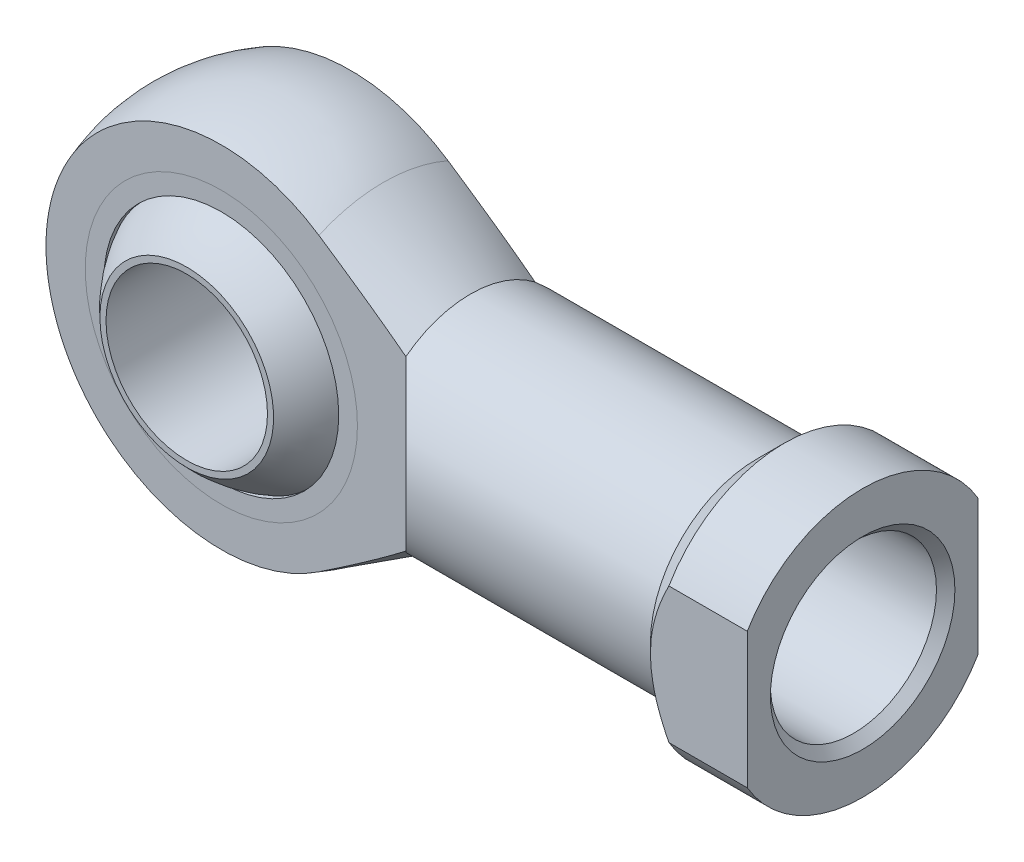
ISO-10303-21;
HEADER;
FILE_DESCRIPTION(('STEP AP214'),'2;1');
FILE_NAME('part.step','',(''),(''),'','','');
FILE_SCHEMA(('AUTOMOTIVE_DESIGN { 1 0 10303 214 1 1 1 1 }'));
ENDSEC;
DATA;
#1=APPLICATION_CONTEXT('core data for automotive mechanical design processes');
#2=APPLICATION_PROTOCOL_DEFINITION('international standard','automotive_design',2000,#1);
#3=PRODUCT_CONTEXT('',#1,'mechanical');
#4=PRODUCT('Part','Part','',(#3));
#5=PRODUCT_RELATED_PRODUCT_CATEGORY('part','',(#4));
#6=PRODUCT_DEFINITION_FORMATION('','',#4);
#7=PRODUCT_DEFINITION_CONTEXT('part definition',#1,'design');
#8=PRODUCT_DEFINITION('design','',#6,#7);
#9=PRODUCT_DEFINITION_SHAPE('','',#8);
#10=(LENGTH_UNIT() NAMED_UNIT(*) SI_UNIT(.MILLI.,.METRE.));
#11=(NAMED_UNIT(*) PLANE_ANGLE_UNIT() SI_UNIT($,.RADIAN.));
#12=(NAMED_UNIT(*) SI_UNIT($,.STERADIAN.) SOLID_ANGLE_UNIT());
#13=UNCERTAINTY_MEASURE_WITH_UNIT(LENGTH_MEASURE(1.E-05),#10,'distance_accuracy_value','');
#14=(GEOMETRIC_REPRESENTATION_CONTEXT(3) GLOBAL_UNCERTAINTY_ASSIGNED_CONTEXT((#13)) GLOBAL_UNIT_ASSIGNED_CONTEXT((#10,
#11,#12)) REPRESENTATION_CONTEXT('',''));
#15=CARTESIAN_POINT('',(0.,0.,0.));
#16=DIRECTION('',(0.,0.,1.));
#17=DIRECTION('',(1.,0.,0.));
#18=AXIS2_PLACEMENT_3D('',#15,#16,#17);
#19=CARTESIAN_POINT('',(0.,0.,0.));
#20=DIRECTION('',(0.,1.,0.));
#21=DIRECTION('',(1.,0.,0.));
#22=AXIS2_PLACEMENT_3D('',#19,#20,#21);
#23=SPHERICAL_SURFACE('',#22,28.575);
#24=CARTESIAN_POINT('',(0.,0.,0.));
#25=DIRECTION('',(0.,0.,-1.));
#26=DIRECTION('',(-1.,0.,0.));
#27=AXIS2_PLACEMENT_3D('',#24,#25,#26);
#28=SPHERICAL_SURFACE('',#27,28.575);
#29=CARTESIAN_POINT('',(0.,0.,21.5));
#30=DIRECTION('',(0.,0.,-1.));
#31=DIRECTION('',(-1.,0.,0.));
#32=AXIS2_PLACEMENT_3D('',#29,#30,#31);
#33=CIRCLE('',#32,18.8223437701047);
#34=CARTESIAN_POINT('',(-18.8223437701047,0.,21.5));
#35=VERTEX_POINT('',#34);
#36=EDGE_CURVE('P0_E26',#35,#35,#33,.F.);
#37=ORIENTED_EDGE('',*,*,#36,.F.);
#38=EDGE_LOOP('',(#37));
#39=FACE_BOUND('',#38,.T.);
#40=CARTESIAN_POINT('',(0.,0.,-21.5));
#41=DIRECTION('',(0.,0.,1.));
#42=DIRECTION('',(1.,0.,0.));
#43=AXIS2_PLACEMENT_3D('',#40,#41,#42);
#44=CIRCLE('',#43,18.8223437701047);
#45=CARTESIAN_POINT('',(18.8223437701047,0.,-21.5));
#46=VERTEX_POINT('',#45);
#47=EDGE_CURVE('P0_E10',#46,#46,#44,.F.);
#48=ORIENTED_EDGE('',*,*,#47,.F.);
#49=EDGE_LOOP('',(#48));
#50=FACE_BOUND('',#49,.T.);
#51=ADVANCED_FACE('P0_F14',(#39,#50),#28,.T.);
#52=CARTESIAN_POINT('',(0.,0.,-28.575));
#53=DIRECTION('',(0.,0.,1.));
#54=DIRECTION('',(1.,0.,0.));
#55=AXIS2_PLACEMENT_3D('',#52,#53,#54);
#56=CYLINDRICAL_SURFACE('',#55,17.5);
#57=CARTESIAN_POINT('',(0.,0.,21.5));
#58=DIRECTION('',(0.,0.,-1.));
#59=DIRECTION('',(-1.,0.,0.));
#60=AXIS2_PLACEMENT_3D('',#57,#58,#59);
#61=CIRCLE('',#60,17.5);
#62=CARTESIAN_POINT('',(-17.5,0.,21.5));
#63=VERTEX_POINT('',#62);
#64=EDGE_CURVE('P0_E17',#63,#63,#61,.F.);
#65=ORIENTED_EDGE('',*,*,#64,.T.);
#66=EDGE_LOOP('',(#65));
#67=FACE_BOUND('',#66,.T.);
#68=CARTESIAN_POINT('',(0.,0.,-21.5));
#69=DIRECTION('',(0.,0.,1.));
#70=DIRECTION('',(1.,0.,0.));
#71=AXIS2_PLACEMENT_3D('',#68,#69,#70);
#72=CIRCLE('',#71,17.5);
#73=CARTESIAN_POINT('',(17.5,0.,-21.5));
#74=VERTEX_POINT('',#73);
#75=EDGE_CURVE('P0_E21',#74,#74,#72,.F.);
#76=ORIENTED_EDGE('',*,*,#75,.T.);
#77=EDGE_LOOP('',(#76));
#78=FACE_BOUND('',#77,.T.);
#79=ADVANCED_FACE('P0_F34',(#67,#78),#56,.F.);
#80=CARTESIAN_POINT('',(-28.575,-28.575,-21.5));
#81=DIRECTION('',(0.,0.,1.));
#82=DIRECTION('',(1.,0.,0.));
#83=AXIS2_PLACEMENT_3D('',#80,#81,#82);
#84=PLANE('',#83);
#85=ORIENTED_EDGE('',*,*,#47,.T.);
#86=EDGE_LOOP('',(#85));
#87=FACE_BOUND('',#86,.T.);
#88=ORIENTED_EDGE('',*,*,#75,.F.);
#89=EDGE_LOOP('',(#88));
#90=FACE_BOUND('',#89,.T.);
#91=ADVANCED_FACE('P0_F39',(#87,#90),#84,.F.);
#92=CARTESIAN_POINT('',(-28.575,-28.575,21.5));
#93=DIRECTION('',(0.,0.,-1.));
#94=DIRECTION('',(-1.,0.,0.));
#95=AXIS2_PLACEMENT_3D('',#92,#93,#94);
#96=PLANE('',#95);
#97=ORIENTED_EDGE('',*,*,#36,.T.);
#98=EDGE_LOOP('',(#97));
#99=FACE_BOUND('',#98,.T.);
#100=ORIENTED_EDGE('',*,*,#64,.F.);
#101=EDGE_LOOP('',(#100));
#102=FACE_BOUND('',#101,.T.);
#103=ADVANCED_FACE('P0_F37',(#99,#102),#96,.F.);
#104=CLOSED_SHELL('',(#51,#79,#91,#103));
#105=MANIFOLD_SOLID_BREP('P0_B1',#104);
#106=CARTESIAN_POINT('',(0.,0.,14.));
#107=DIRECTION('',(0.,0.,1.));
#108=DIRECTION('',(1.,0.,0.));
#109=AXIS2_PLACEMENT_3D('',#106,#107,#108);
#110=PLANE('',#109);
#111=CARTESIAN_POINT('',(0.,0.,14.));
#112=DIRECTION('',(0.,0.,1.));
#113=DIRECTION('',(1.,0.,0.));
#114=AXIS2_PLACEMENT_3D('',#111,#112,#113);
#115=CIRCLE('',#114,29.5);
#116=CARTESIAN_POINT('',(29.5,0.,14.));
#117=VERTEX_POINT('',#116);
#118=EDGE_CURVE('P1_E10',#117,#117,#115,.T.);
#119=ORIENTED_EDGE('',*,*,#118,.T.);
#120=EDGE_LOOP('',(#119));
#121=FACE_BOUND('',#120,.T.);
#122=CARTESIAN_POINT('',(0.,0.,14.));
#123=DIRECTION('',(0.,0.,1.));
#124=DIRECTION('',(1.,0.,0.));
#125=AXIS2_PLACEMENT_3D('',#122,#123,#124);
#126=CIRCLE('',#125,25.445);
#127=CARTESIAN_POINT('',(25.445,0.,14.));
#128=VERTEX_POINT('',#127);
#129=EDGE_CURVE('P1_E25',#128,#128,#126,.T.);
#130=ORIENTED_EDGE('',*,*,#129,.F.);
#131=EDGE_LOOP('',(#130));
#132=FACE_BOUND('',#131,.T.);
#133=ADVANCED_FACE('P1_F14',(#121,#132),#110,.T.);
#134=CARTESIAN_POINT('',(0.,0.,13.));
#135=DIRECTION('',(0.,0.,1.));
#136=DIRECTION('',(1.,0.,0.));
#137=AXIS2_PLACEMENT_3D('',#134,#135,#136);
#138=PLANE('',#137);
#139=CARTESIAN_POINT('',(0.,0.,13.));
#140=DIRECTION('',(0.,0.,1.));
#141=DIRECTION('',(1.,0.,0.));
#142=AXIS2_PLACEMENT_3D('',#139,#140,#141);
#143=CIRCLE('',#142,29.5);
#144=CARTESIAN_POINT('',(29.5,0.,13.));
#145=VERTEX_POINT('',#144);
#146=EDGE_CURVE('P1_E18',#145,#145,#143,.T.);
#147=ORIENTED_EDGE('',*,*,#146,.F.);
#148=EDGE_LOOP('',(#147));
#149=FACE_BOUND('',#148,.T.);
#150=CARTESIAN_POINT('',(0.,0.,13.));
#151=DIRECTION('',(0.,0.,1.));
#152=DIRECTION('',(1.,0.,0.));
#153=AXIS2_PLACEMENT_3D('',#150,#151,#152);
#154=CIRCLE('',#153,25.445);
#155=CARTESIAN_POINT('',(25.445,0.,13.));
#156=VERTEX_POINT('',#155);
#157=EDGE_CURVE('P1_E27',#156,#156,#154,.T.);
#158=ORIENTED_EDGE('',*,*,#157,.T.);
#159=EDGE_LOOP('',(#158));
#160=FACE_BOUND('',#159,.T.);
#161=ADVANCED_FACE('P1_F37',(#149,#160),#138,.F.);
#162=CARTESIAN_POINT('',(0.,0.,14.));
#163=DIRECTION('',(0.,0.,-1.));
#164=DIRECTION('',(-1.,0.,0.));
#165=AXIS2_PLACEMENT_3D('',#162,#163,#164);
#166=CYLINDRICAL_SURFACE('',#165,29.5);
#167=ORIENTED_EDGE('',*,*,#118,.F.);
#168=EDGE_LOOP('',(#167));
#169=FACE_BOUND('',#168,.T.);
#170=ORIENTED_EDGE('',*,*,#146,.T.);
#171=EDGE_LOOP('',(#170));
#172=FACE_BOUND('',#171,.T.);
#173=ADVANCED_FACE('P1_F16',(#169,#172),#166,.T.);
#174=CARTESIAN_POINT('',(0.,0.,14.));
#175=DIRECTION('',(0.,0.,-1.));
#176=DIRECTION('',(-1.,0.,0.));
#177=AXIS2_PLACEMENT_3D('',#174,#175,#176);
#178=CYLINDRICAL_SURFACE('',#177,25.445);
#179=ORIENTED_EDGE('',*,*,#129,.T.);
#180=EDGE_LOOP('',(#179));
#181=FACE_BOUND('',#180,.T.);
#182=ORIENTED_EDGE('',*,*,#157,.F.);
#183=EDGE_LOOP('',(#182));
#184=FACE_BOUND('',#183,.T.);
#185=ADVANCED_FACE('P1_F33',(#181,#184),#178,.F.);
#186=CLOSED_SHELL('',(#133,#161,#173,#185));
#187=MANIFOLD_SOLID_BREP('P1_B1',#186);
#188=CARTESIAN_POINT('',(0.,0.,-13.));
#189=DIRECTION('',(0.,0.,1.));
#190=DIRECTION('',(1.,0.,0.));
#191=AXIS2_PLACEMENT_3D('',#188,#189,#190);
#192=PLANE('',#191);
#193=CARTESIAN_POINT('',(0.,0.,-13.));
#194=DIRECTION('',(0.,0.,1.));
#195=DIRECTION('',(1.,0.,0.));
#196=AXIS2_PLACEMENT_3D('',#193,#194,#195);
#197=CIRCLE('',#196,29.5);
#198=CARTESIAN_POINT('',(29.5,0.,-13.));
#199=VERTEX_POINT('',#198);
#200=EDGE_CURVE('P2_E10',#199,#199,#197,.T.);
#201=ORIENTED_EDGE('',*,*,#200,.T.);
#202=EDGE_LOOP('',(#201));
#203=FACE_BOUND('',#202,.T.);
#204=CARTESIAN_POINT('',(0.,0.,-13.));
#205=DIRECTION('',(0.,0.,1.));
#206=DIRECTION('',(1.,0.,0.));
#207=AXIS2_PLACEMENT_3D('',#204,#205,#206);
#208=CIRCLE('',#207,25.445);
#209=CARTESIAN_POINT('',(25.445,0.,-13.));
#210=VERTEX_POINT('',#209);
#211=EDGE_CURVE('P2_E25',#210,#210,#208,.T.);
#212=ORIENTED_EDGE('',*,*,#211,.F.);
#213=EDGE_LOOP('',(#212));
#214=FACE_BOUND('',#213,.T.);
#215=ADVANCED_FACE('P2_F14',(#203,#214),#192,.T.);
#216=CARTESIAN_POINT('',(0.,0.,-14.));
#217=DIRECTION('',(0.,0.,1.));
#218=DIRECTION('',(1.,0.,0.));
#219=AXIS2_PLACEMENT_3D('',#216,#217,#218);
#220=PLANE('',#219);
#221=CARTESIAN_POINT('',(0.,0.,-14.));
#222=DIRECTION('',(0.,0.,1.));
#223=DIRECTION('',(1.,0.,0.));
#224=AXIS2_PLACEMENT_3D('',#221,#222,#223);
#225=CIRCLE('',#224,29.5);
#226=CARTESIAN_POINT('',(29.5,0.,-14.));
#227=VERTEX_POINT('',#226);
#228=EDGE_CURVE('P2_E18',#227,#227,#225,.T.);
#229=ORIENTED_EDGE('',*,*,#228,.F.);
#230=EDGE_LOOP('',(#229));
#231=FACE_BOUND('',#230,.T.);
#232=CARTESIAN_POINT('',(0.,0.,-14.));
#233=DIRECTION('',(0.,0.,1.));
#234=DIRECTION('',(1.,0.,0.));
#235=AXIS2_PLACEMENT_3D('',#232,#233,#234);
#236=CIRCLE('',#235,25.445);
#237=CARTESIAN_POINT('',(25.445,0.,-14.));
#238=VERTEX_POINT('',#237);
#239=EDGE_CURVE('P2_E27',#238,#238,#236,.T.);
#240=ORIENTED_EDGE('',*,*,#239,.T.);
#241=EDGE_LOOP('',(#240));
#242=FACE_BOUND('',#241,.T.);
#243=ADVANCED_FACE('P2_F37',(#231,#242),#220,.F.);
#244=CARTESIAN_POINT('',(0.,0.,-13.));
#245=DIRECTION('',(0.,0.,-1.));
#246=DIRECTION('',(-1.,0.,0.));
#247=AXIS2_PLACEMENT_3D('',#244,#245,#246);
#248=CYLINDRICAL_SURFACE('',#247,29.5);
#249=ORIENTED_EDGE('',*,*,#200,.F.);
#250=EDGE_LOOP('',(#249));
#251=FACE_BOUND('',#250,.T.);
#252=ORIENTED_EDGE('',*,*,#228,.T.);
#253=EDGE_LOOP('',(#252));
#254=FACE_BOUND('',#253,.T.);
#255=ADVANCED_FACE('P2_F16',(#251,#254),#248,.T.);
#256=CARTESIAN_POINT('',(0.,0.,-13.));
#257=DIRECTION('',(0.,0.,-1.));
#258=DIRECTION('',(-1.,0.,0.));
#259=AXIS2_PLACEMENT_3D('',#256,#257,#258);
#260=CYLINDRICAL_SURFACE('',#259,25.445);
#261=ORIENTED_EDGE('',*,*,#211,.T.);
#262=EDGE_LOOP('',(#261));
#263=FACE_BOUND('',#262,.T.);
#264=ORIENTED_EDGE('',*,*,#239,.F.);
#265=EDGE_LOOP('',(#264));
#266=FACE_BOUND('',#265,.T.);
#267=ADVANCED_FACE('P2_F33',(#263,#266),#260,.F.);
#268=CLOSED_SHELL('',(#215,#243,#255,#267));
#269=MANIFOLD_SOLID_BREP('P2_B1',#268);
#270=CARTESIAN_POINT('',(0.,0.,0.));
#271=DIRECTION('',(0.,1.,0.));
#272=DIRECTION('',(1.,0.,0.));
#273=AXIS2_PLACEMENT_3D('',#270,#271,#272);
#274=SPHERICAL_SURFACE('',#273,28.575);
#275=CARTESIAN_POINT('',(0.,0.,0.));
#276=DIRECTION('',(0.,0.,1.));
#277=DIRECTION('',(1.,0.,0.));
#278=AXIS2_PLACEMENT_3D('',#275,#276,#277);
#279=SPHERICAL_SURFACE('',#278,28.575);
#280=CARTESIAN_POINT('',(0.,0.,13.));
#281=DIRECTION('',(0.,0.,1.));
#282=DIRECTION('',(1.,0.,0.));
#283=AXIS2_PLACEMENT_3D('',#280,#281,#282);
#284=CIRCLE('',#283,25.4466230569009);
#285=CARTESIAN_POINT('',(25.4466230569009,0.,13.));
#286=VERTEX_POINT('',#285);
#287=EDGE_CURVE('P3_E73',#286,#286,#284,.F.);
#288=ORIENTED_EDGE('',*,*,#287,.F.);
#289=EDGE_LOOP('',(#288));
#290=FACE_BOUND('',#289,.T.);
#291=CARTESIAN_POINT('',(0.,0.,-13.));
#292=DIRECTION('',(0.,0.,-1.));
#293=DIRECTION('',(-1.,0.,0.));
#294=AXIS2_PLACEMENT_3D('',#291,#292,#293);
#295=CIRCLE('',#294,25.4466230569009);
#296=CARTESIAN_POINT('',(-25.4466230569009,0.,-13.));
#297=VERTEX_POINT('',#296);
#298=EDGE_CURVE('P3_E20',#297,#297,#295,.F.);
#299=ORIENTED_EDGE('',*,*,#298,.F.);
#300=EDGE_LOOP('',(#299));
#301=FACE_BOUND('',#300,.T.);
#302=ADVANCED_FACE('P3_F16',(#290,#301),#279,.F.);
#303=CARTESIAN_POINT('',(-40.,-40.5,-14.));
#304=DIRECTION('',(0.,0.,1.));
#305=DIRECTION('',(1.,0.,0.));
#306=AXIS2_PLACEMENT_3D('',#303,#304,#305);
#307=PLANE('',#306);
#308=CARTESIAN_POINT('',(0.,0.,-14.));
#309=DIRECTION('',(0.,0.,1.));
#310=DIRECTION('',(1.,0.,0.));
#311=AXIS2_PLACEMENT_3D('',#308,#309,#310);
#312=CIRCLE('',#311,38.0032893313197);
#313=CARTESIAN_POINT('',(21.1445213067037,31.5778279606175,-14.));
#314=VERTEX_POINT('',#313);
#315=CARTESIAN_POINT('',(21.1445213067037,-31.5778279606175,-14.));
#316=VERTEX_POINT('',#315);
#317=EDGE_CURVE('P3_E11',#314,#316,#312,.T.);
#318=ORIENTED_EDGE('',*,*,#317,.F.);
#319=CARTESIAN_POINT('',(-192.834553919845,-164.933541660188,-14.));
#320=CARTESIAN_POINT('',(-188.969420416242,-162.55903992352,-14.));
#321=CARTESIAN_POINT('',(-185.104448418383,-160.184275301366,-14.));
#322=CARTESIAN_POINT('',(-177.374878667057,-155.434136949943,-14.));
#323=CARTESIAN_POINT('',(-173.510280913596,-153.058763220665,-14.));
#324=CARTESIAN_POINT('',(-161.917113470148,-145.931595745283,-14.));
#325=CARTESIAN_POINT('',(-154.18918217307,-141.178763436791,-14.));
#326=CARTESIAN_POINT('',(-138.735144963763,-131.669093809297,-14.));
#327=CARTESIAN_POINT('',(-131.009039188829,-126.912256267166,-14.));
#328=CARTESIAN_POINT('',(-115.560008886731,-117.393440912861,-14.));
#329=CARTESIAN_POINT('',(-107.837084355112,-112.631463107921,-14.));
#330=CARTESIAN_POINT('',(-96.2648781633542,-105.488255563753,-14.));
#331=CARTESIAN_POINT('',(-92.4138597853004,-103.109839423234,-14.));
#332=CARTESIAN_POINT('',(-84.7132472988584,-98.3507025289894,-14.));
#333=CARTESIAN_POINT('',(-80.8636531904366,-95.9699817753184,-14.));
#334=CARTESIAN_POINT('',(-73.1662189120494,-91.205668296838,-14.));
#335=CARTESIAN_POINT('',(-69.3183787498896,-88.8220755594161,-14.));
#336=CARTESIAN_POINT('',(-61.6249446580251,-84.0512690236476,-14.));
#337=CARTESIAN_POINT('',(-57.7793507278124,-81.6640552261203,-14.));
#338=CARTESIAN_POINT('',(-50.0911840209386,-76.8850192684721,-14.));
#339=CARTESIAN_POINT('',(-46.2486111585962,-74.4931972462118,-14.));
#340=CARTESIAN_POINT('',(-38.5673157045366,-69.703378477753,-14.));
#341=CARTESIAN_POINT('',(-34.7285931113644,-67.3053817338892,-14.));
#342=CARTESIAN_POINT('',(-28.9744904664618,-63.7020568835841,-14.));
#343=CARTESIAN_POINT('',(-27.0571260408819,-62.4998975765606,-14.));
#344=CARTESIAN_POINT('',(-23.2239762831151,-60.0930643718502,-14.));
#345=CARTESIAN_POINT('',(-21.3081909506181,-58.8883904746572,-14.));
#346=CARTESIAN_POINT('',(-17.4785145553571,-56.4760430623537,-14.));
#347=CARTESIAN_POINT('',(-15.564623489,-55.2683695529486,-14.));
#348=CARTESIAN_POINT('',(-11.7391355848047,-52.8493950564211,-14.));
#349=CARTESIAN_POINT('',(-9.82753874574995,-51.6380940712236,-14.));
#350=CARTESIAN_POINT('',(-6.815789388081,-49.7247493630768,-14.));
#351=CARTESIAN_POINT('',(-5.71469308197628,-49.0241911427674,-14.));
#352=CARTESIAN_POINT('',(-3.51357034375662,-47.6213947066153,-14.));
#353=CARTESIAN_POINT('',(-2.41354391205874,-46.9191564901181,-14.));
#354=CARTESIAN_POINT('',(-0.214707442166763,-45.5127658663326,-14.));
#355=CARTESIAN_POINT('',(0.88410258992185,-44.8086134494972,-14.));
#356=CARTESIAN_POINT('',(3.08031758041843,-43.3981206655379,-14.));
#357=CARTESIAN_POINT('',(4.17772253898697,-42.6917802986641,-14.));
#358=CARTESIAN_POINT('',(6.37167548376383,-41.2760810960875,-14.));
#359=CARTESIAN_POINT('',(7.4682223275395,-40.5667204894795,-14.));
#360=CARTESIAN_POINT('',(9.65941364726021,-39.1450673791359,-14.));
#361=CARTESIAN_POINT('',(10.7540581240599,-38.4327748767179,-14.));
#362=CARTESIAN_POINT('',(12.9410986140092,-37.0047635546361,-14.));
#363=CARTESIAN_POINT('',(14.0334946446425,-36.2890447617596,-14.));
#364=CARTESIAN_POINT('',(16.215618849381,-34.8535528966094,-14.));
#365=CARTESIAN_POINT('',(17.3053470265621,-34.1337798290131,-14.));
#366=CARTESIAN_POINT('',(19.7387500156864,-32.518728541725,-14.));
#367=CARTESIAN_POINT('',(21.0815778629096,-31.6221731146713,-14.));
#368=CARTESIAN_POINT('',(23.7609963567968,-29.819729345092,-14.));
#369=CARTESIAN_POINT('',(25.0975869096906,-28.9138408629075,-14.));
#370=CARTESIAN_POINT('',(27.0953823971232,-27.5465749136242,-14.));
#371=CARTESIAN_POINT('',(27.7596866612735,-27.0897251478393,-14.));
#372=CARTESIAN_POINT('',(29.0858984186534,-26.1725612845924,-14.));
#373=CARTESIAN_POINT('',(29.7478059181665,-25.7122471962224,-14.));
#374=CARTESIAN_POINT('',(31.0688017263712,-24.7876384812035,-14.));
#375=CARTESIAN_POINT('',(31.7278901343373,-24.3233439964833,-14.));
#376=CARTESIAN_POINT('',(33.0427635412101,-23.3901041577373,-14.));
#377=CARTESIAN_POINT('',(33.6985485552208,-22.9211588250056,-14.));
#378=CARTESIAN_POINT('',(35.1688656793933,-21.860456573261,-14.));
#379=CARTESIAN_POINT('',(35.9822985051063,-21.2671735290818,-14.));
#380=CARTESIAN_POINT('',(37.6014123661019,-20.0700984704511,-14.));
#381=CARTESIAN_POINT('',(38.4070934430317,-19.4663065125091,-14.));
#382=CARTESIAN_POINT('',(39.609617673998,-18.5494690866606,-14.));
#383=CARTESIAN_POINT('',(40.0102421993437,-18.2413808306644,-14.));
#384=CARTESIAN_POINT('',(40.8085287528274,-17.6214244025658,-14.));
#385=CARTESIAN_POINT('',(41.2061909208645,-17.3095564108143,-14.));
#386=CARTESIAN_POINT('',(41.9979835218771,-16.6816017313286,-14.));
#387=CARTESIAN_POINT('',(42.3921149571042,-16.3655163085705,-14.));
#388=CARTESIAN_POINT('',(43.1764388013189,-15.7283663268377,-14.));
#389=CARTESIAN_POINT('',(43.5666305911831,-15.4073010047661,-14.));
#390=CARTESIAN_POINT('',(44.3457063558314,-14.7566325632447,-14.));
#391=CARTESIAN_POINT('',(44.734548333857,-14.4269790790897,-14.));
#392=CARTESIAN_POINT('',(45.5064710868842,-13.7609567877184,-14.));
#393=CARTESIAN_POINT('',(45.8895516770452,-13.4245877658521,-14.));
#394=CARTESIAN_POINT('',(46.648609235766,-12.7440968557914,-14.));
#395=CARTESIAN_POINT('',(47.024587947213,-12.3999769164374,-14.));
#396=CARTESIAN_POINT('',(47.7678905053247,-11.7025386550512,-14.));
#397=CARTESIAN_POINT('',(48.1352149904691,-11.3492210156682,-14.));
#398=CARTESIAN_POINT('',(48.8573685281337,-10.6333306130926,-14.));
#399=CARTESIAN_POINT('',(49.2122480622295,-10.2708089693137,-14.));
#400=CARTESIAN_POINT('',(49.9084580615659,-9.53277257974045,-14.));
#401=CARTESIAN_POINT('',(50.2497858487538,-9.15725529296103,-14.));
#402=CARTESIAN_POINT('',(50.914047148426,-8.39156383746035,-14.));
#403=CARTESIAN_POINT('',(51.2370172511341,-8.00142159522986,-14.));
#404=CARTESIAN_POINT('',(51.8594808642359,-7.2029495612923,-14.));
#405=CARTESIAN_POINT('',(52.1589877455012,-6.79463033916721,-14.));
#406=CARTESIAN_POINT('',(52.6253406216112,-6.10579202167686,-14.));
#407=CARTESIAN_POINT('',(52.8014433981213,-5.83154946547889,-14.));
#408=CARTESIAN_POINT('',(53.1376649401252,-5.27329085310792,-14.));
#409=CARTESIAN_POINT('',(53.2977809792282,-4.98927314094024,-14.));
#410=CARTESIAN_POINT('',(53.5981652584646,-4.41152526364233,-14.));
#411=CARTESIAN_POINT('',(53.7384700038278,-4.11781422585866,-14.));
#412=CARTESIAN_POINT('',(53.9953916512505,-3.52017939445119,-14.));
#413=CARTESIAN_POINT('',(54.1120164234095,-3.21625903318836,-14.));
#414=CARTESIAN_POINT('',(54.2923698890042,-2.67334974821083,-14.));
#415=CARTESIAN_POINT('',(54.3620735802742,-2.43634636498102,-14.));
#416=CARTESIAN_POINT('',(54.4832893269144,-1.95771714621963,-14.));
#417=CARTESIAN_POINT('',(54.534803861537,-1.71609194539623,-14.));
#418=CARTESIAN_POINT('',(54.6179394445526,-1.22964049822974,-14.));
#419=CARTESIAN_POINT('',(54.6495788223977,-0.98481741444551,-14.));
#420=CARTESIAN_POINT('',(54.6919073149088,-0.493336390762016,-14.));
#421=CARTESIAN_POINT('',(54.7025945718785,-0.246678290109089,-14.));
#422=CARTESIAN_POINT('',(54.7025851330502,0.285744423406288,-14.));
#423=CARTESIAN_POINT('',(54.688233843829,0.571515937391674,-14.));
#424=CARTESIAN_POINT('',(54.6315479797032,1.14025742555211,-14.));
#425=CARTESIAN_POINT('',(54.5892093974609,1.42322699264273,-14.));
#426=CARTESIAN_POINT('',(54.4784614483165,1.98447050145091,-14.));
#427=CARTESIAN_POINT('',(54.4100070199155,2.26273545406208,-14.));
#428=CARTESIAN_POINT('',(54.249854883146,2.81244211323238,-14.));
#429=CARTESIAN_POINT('',(54.158153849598,3.08388283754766,-14.));
#430=CARTESIAN_POINT('',(53.9093655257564,3.73802766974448,-14.));
#431=CARTESIAN_POINT('',(53.7413313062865,4.11656549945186,-14.));
#432=CARTESIAN_POINT('',(53.3721555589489,4.85708710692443,-14.));
#433=CARTESIAN_POINT('',(53.1709929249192,5.219060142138,-14.));
#434=CARTESIAN_POINT('',(52.7423184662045,5.92854269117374,-14.));
#435=CARTESIAN_POINT('',(52.514722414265,6.27600089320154,-14.));
#436=CARTESIAN_POINT('',(52.1583656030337,6.78651082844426,-14.));
#437=CARTESIAN_POINT('',(52.0371010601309,6.95488244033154,-14.));
#438=CARTESIAN_POINT('',(51.790121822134,7.28833352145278,-14.));
#439=CARTESIAN_POINT('',(51.6644071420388,7.45341300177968,-14.));
#440=CARTESIAN_POINT('',(51.31709945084,7.89826910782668,-14.));
#441=CARTESIAN_POINT('',(51.0916524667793,8.17503901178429,-14.));
#442=CARTESIAN_POINT('',(50.6312276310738,8.7205636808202,-14.));
#443=CARTESIAN_POINT('',(50.3962482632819,8.98931715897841,-14.));
#444=CARTESIAN_POINT('',(49.9182821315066,9.51988777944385,-14.));
#445=CARTESIAN_POINT('',(49.6752905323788,9.7817005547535,-14.));
#446=CARTESIAN_POINT('',(49.1827509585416,10.2990419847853,-14.));
#447=CARTESIAN_POINT('',(48.9332033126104,10.5545709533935,-14.));
#448=CARTESIAN_POINT('',(48.4279605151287,11.0607020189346,-14.));
#449=CARTESIAN_POINT('',(48.172251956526,11.3112907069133,-14.));
#450=CARTESIAN_POINT('',(47.6560912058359,11.8075406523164,-14.));
#451=CARTESIAN_POINT('',(47.3956388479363,12.0532017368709,-14.));
#452=CARTESIAN_POINT('',(46.608387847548,12.7834702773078,-14.));
#453=CARTESIAN_POINT('',(46.0755181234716,13.261538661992,-14.));
#454=CARTESIAN_POINT('',(44.9943944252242,14.2065950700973,-14.));
#455=CARTESIAN_POINT('',(44.4460666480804,14.6734981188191,-14.));
#456=CARTESIAN_POINT('',(43.339878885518,15.595914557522,-14.));
#457=CARTESIAN_POINT('',(42.782018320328,16.051427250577,-14.));
#458=CARTESIAN_POINT('',(41.6596746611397,16.9523827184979,-14.));
#459=CARTESIAN_POINT('',(41.0952032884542,17.3978401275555,-14.));
#460=CARTESIAN_POINT('',(40.2439850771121,18.0601940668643,-14.));
#461=CARTESIAN_POINT('',(39.9594976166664,18.2800038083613,-14.));
#462=CARTESIAN_POINT('',(39.3891553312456,18.7178424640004,-14.));
#463=CARTESIAN_POINT('',(39.103300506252,18.9358713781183,-14.));
#464=CARTESIAN_POINT('',(38.2525323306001,19.5809546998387,-14.));
#465=CARTESIAN_POINT('',(37.6858387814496,20.0056625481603,-14.));
#466=CARTESIAN_POINT('',(36.5484621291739,20.8497075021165,-14.));
#467=CARTESIAN_POINT('',(35.977778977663,21.2690445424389,-14.));
#468=CARTESIAN_POINT('',(34.8330315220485,22.1031249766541,-14.));
#469=CARTESIAN_POINT('',(34.2589670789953,22.5178681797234,-14.));
#470=CARTESIAN_POINT('',(33.1079755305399,23.3433652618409,-14.));
#471=CARTESIAN_POINT('',(32.5310484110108,23.7541191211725,-14.));
#472=CARTESIAN_POINT('',(30.7963915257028,24.9813387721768,-14.));
#473=CARTESIAN_POINT('',(29.634989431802,25.7926152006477,-14.));
#474=CARTESIAN_POINT('',(27.3048479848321,27.4044806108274,-14.));
#475=CARTESIAN_POINT('',(26.1361087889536,28.2050698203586,-14.));
#476=CARTESIAN_POINT('',(23.7916377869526,29.7986738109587,-14.));
#477=CARTESIAN_POINT('',(22.6158997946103,30.5916794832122,-14.));
#478=CARTESIAN_POINT('',(20.2598698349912,32.1709018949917,-14.));
#479=CARTESIAN_POINT('',(19.0795778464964,32.9571186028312,-14.));
#480=CARTESIAN_POINT('',(16.7154432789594,34.5239249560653,-14.));
#481=CARTESIAN_POINT('',(15.5316010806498,35.3045151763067,-14.));
#482=CARTESIAN_POINT('',(13.1609080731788,36.8611068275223,-14.));
#483=CARTESIAN_POINT('',(11.9740572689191,37.6371082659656,-14.));
#484=CARTESIAN_POINT('',(9.60498903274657,39.1806244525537,-14.));
#485=CARTESIAN_POINT('',(8.42278656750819,39.9481621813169,-14.));
#486=CARTESIAN_POINT('',(6.05630035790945,41.4800231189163,-14.));
#487=CARTESIAN_POINT('',(4.87201661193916,42.2443463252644,-14.));
#488=CARTESIAN_POINT('',(1.31647203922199,44.5332563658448,-14.));
#489=CARTESIAN_POINT('',(-1.05742584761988,46.0537470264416,-14.));
#490=CARTESIAN_POINT('',(-5.80918320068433,49.0858113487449,-14.));
#491=CARTESIAN_POINT('',(-8.18703999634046,50.5973892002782,-14.));
#492=CARTESIAN_POINT('',(-12.9466936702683,53.6142828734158,-14.));
#493=CARTESIAN_POINT('',(-15.328490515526,55.1195987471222,-14.));
#494=CARTESIAN_POINT('',(-19.5172675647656,57.7609131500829,-14.));
#495=CARTESIAN_POINT('',(-21.3235889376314,58.8979570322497,-14.));
#496=CARTESIAN_POINT('',(-24.9377278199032,61.1696648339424,-14.));
#497=CARTESIAN_POINT('',(-26.7455453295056,62.3043287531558,-14.));
#498=CARTESIAN_POINT('',(-32.1708912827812,65.7053060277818,-14.));
#499=CARTESIAN_POINT('',(-35.790310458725,67.9686032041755,-14.));
#500=CARTESIAN_POINT('',(-43.0328768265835,72.4892691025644,-14.));
#501=CARTESIAN_POINT('',(-46.6560240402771,74.7466377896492,-14.));
#502=CARTESIAN_POINT('',(-53.9051423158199,79.2568372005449,-14.));
#503=CARTESIAN_POINT('',(-57.5311133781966,81.5096679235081,-14.));
#504=CARTESIAN_POINT('',(-64.7861084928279,86.0123239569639,-14.));
#505=CARTESIAN_POINT('',(-68.4151330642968,88.2621484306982,-14.));
#506=CARTESIAN_POINT('',(-75.6749257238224,92.7589829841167,-14.));
#507=CARTESIAN_POINT('',(-79.3056938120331,95.0059930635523,-14.));
#508=CARTESIAN_POINT('',(-86.5686257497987,99.4977334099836,-14.));
#509=CARTESIAN_POINT('',(-90.2007895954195,101.742463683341,-14.));
#510=CARTESIAN_POINT('',(-97.4662702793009,106.230057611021,-14.));
#511=CARTESIAN_POINT('',(-101.099587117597,108.472921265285,-14.));
#512=CARTESIAN_POINT('',(-112.070847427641,115.24232722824,-14.));
#513=CARTESIAN_POINT('',(-119.41025044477,119.766504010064,-14.));
#514=CARTESIAN_POINT('',(-134.091786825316,128.810439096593,-14.));
#515=CARTESIAN_POINT('',(-141.433920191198,133.330197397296,-14.));
#516=CARTESIAN_POINT('',(-156.118285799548,142.365280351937,-14.));
#517=CARTESIAN_POINT('',(-163.460517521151,146.880605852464,-14.));
#518=CARTESIAN_POINT('',(-174.474998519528,153.651741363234,-14.));
#519=CARTESIAN_POINT('',(-178.146679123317,155.908476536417,-14.));
#520=CARTESIAN_POINT('',(-185.490375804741,160.421400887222,-14.));
#521=CARTESIAN_POINT('',(-189.162391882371,162.67759006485,-14.));
#522=CARTESIAN_POINT('',(-192.834553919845,164.933541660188,-14.));
#523=B_SPLINE_CURVE_WITH_KNOTS('',3,(#319,#320,#321,#322,#323,#324,#325,#326,#327,#328,#329,
#330,#331,#332,#333,#334,#335,#336,#337,#338,#339,#340,#341,#342,#343,#344,#345,#346,#347,#348,
#349,#350,#351,#352,#353,#354,#355,#356,#357,#358,#359,#360,#361,#362,#363,#364,#365,#366,#367,
#368,#369,#370,#371,#372,#373,#374,#375,#376,#377,#378,#379,#380,#381,#382,#383,#384,#385,#386,
#387,#388,#389,#390,#391,#392,#393,#394,#395,#396,#397,#398,#399,#400,#401,#402,#403,#404,#405,
#406,#407,#408,#409,#410,#411,#412,#413,#414,#415,#416,#417,#418,#419,#420,#421,#422,#423,#424,
#425,#426,#427,#428,#429,#430,#431,#432,#433,#434,#435,#436,#437,#438,#439,#440,#441,#442,#443,
#444,#445,#446,#447,#448,#449,#450,#451,#452,#453,#454,#455,#456,#457,#458,#459,#460,#461,#462,
#463,#464,#465,#466,#467,#468,#469,#470,#471,#472,#473,#474,#475,#476,#477,#478,#479,#480,#481,
#482,#483,#484,#485,#486,#487,#488,#489,#490,#491,#492,#493,#494,#495,#496,#497,#498,#499,#500,
#501,#502,#503,#504,#505,#506,#507,#508,#509,#510,#511,#512,#513,#514,#515,#516,#517,#518,#519,
#520,#521,#522),.UNSPECIFIED.,.F.,.F.,(4,2,2,2,2,2,2,2,2,2,2,2,2,2,2,2,2,2,2,2,2,2,2,2,2,2,2,2,
2,2,2,2,2,2,2,2,2,2,2,2,2,2,2,2,2,2,2,2,2,2,2,2,2,2,2,2,2,2,2,2,2,2,2,2,2,2,2,2,2,2,2,2,2,2,2,2,
2,2,2,2,2,2,2,2,2,2,2,2,2,2,2,2,2,2,2,2,2,2,2,2,2,4),(0.,13.6087339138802,27.2174680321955,
54.4349805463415,81.6541256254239,108.873232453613,122.452070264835,136.030907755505,
149.609805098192,163.188699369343,176.767193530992,190.345682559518,197.134882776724,
203.924081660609,210.713267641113,217.502450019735,221.417644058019,225.332839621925,
229.24805474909,233.163269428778,237.081232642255,240.999194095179,244.917124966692,
248.835051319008,253.678883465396,258.522788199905,260.941478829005,263.360163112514,
265.778761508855,268.197348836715,271.217702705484,274.238040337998,275.754190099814,
277.270267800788,278.785900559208,280.301767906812,281.831025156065,283.36033136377,
284.889257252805,286.418069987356,287.939719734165,289.461668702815,290.98046933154,
292.498398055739,293.475714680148,294.45319769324,295.428855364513,296.404188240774,
297.144681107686,297.885073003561,298.624781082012,299.364554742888,300.221485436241,
301.078538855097,301.93707781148,302.795739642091,304.036020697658,305.277095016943,
306.52223837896,307.144666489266,307.767092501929,308.837723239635,309.908524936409,
310.979985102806,312.051391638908,313.125389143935,314.199424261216,316.346746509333,
318.507116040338,320.667617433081,322.824740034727,323.903272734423,324.981805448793,
327.106302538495,329.230825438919,331.355436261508,333.48005757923,337.730053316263,
341.979958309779,346.234450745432,350.488963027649,354.743034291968,358.997098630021,
363.225620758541,367.454146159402,375.911398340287,384.364294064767,392.817119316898,
399.220319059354,405.62351964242,418.429930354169,431.236416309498,444.042904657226,
456.852421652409,469.661939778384,482.471422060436,495.280904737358,521.146228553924,
547.011575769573,572.87020572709,585.799506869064,598.728807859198),.UNSPECIFIED.);
#524=CARTESIAN_POINT('',(40.,18.2482875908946,-14.));
#525=VERTEX_POINT('',#524);
#526=EDGE_CURVE('P3_E102',#525,#314,#523,.T.);
#527=ORIENTED_EDGE('',*,*,#526,.F.);
#528=DIRECTION('',(0.,1.,0.));
#529=VECTOR('',#528,1.);
#530=CARTESIAN_POINT('',(40.,-40.5,-14.));
#531=LINE('',#530,#529);
#532=CARTESIAN_POINT('',(40.,-18.2482875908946,-14.));
#533=VERTEX_POINT('',#532);
#534=EDGE_CURVE('P3_E64',#533,#525,#531,.T.);
#535=ORIENTED_EDGE('',*,*,#534,.F.);
#536=EDGE_CURVE('P3_E33',#316,#533,#523,.T.);
#537=ORIENTED_EDGE('',*,*,#536,.F.);
#538=EDGE_LOOP('',(#318,#527,#535,#537));
#539=FACE_BOUND('',#538,.T.);
#540=CARTESIAN_POINT('',(0.,0.,-14.));
#541=DIRECTION('',(0.,0.,1.));
#542=DIRECTION('',(1.,0.,0.));
#543=AXIS2_PLACEMENT_3D('',#540,#541,#542);
#544=CIRCLE('',#543,29.5);
#545=CARTESIAN_POINT('',(29.5,0.,-14.));
#546=VERTEX_POINT('',#545);
#547=EDGE_CURVE('P3_E95',#546,#546,#544,.T.);
#548=ORIENTED_EDGE('',*,*,#547,.T.);
#549=EDGE_LOOP('',(#548));
#550=FACE_BOUND('',#549,.T.);
#551=ADVANCED_FACE('P3_F115',(#539,#550),#307,.F.);
#552=CARTESIAN_POINT('',(40.,0.,0.));
#553=DIRECTION('',(-1.,0.,0.));
#554=DIRECTION('',(0.,0.,1.));
#555=AXIS2_PLACEMENT_3D('',#552,#553,#554);
#556=CONICAL_SURFACE('',#555,23.,0.549296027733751);
#557=CARTESIAN_POINT('',(21.1445213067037,0.,0.));
#558=DIRECTION('',(-1.,0.,0.));
#559=DIRECTION('',(0.,0.,1.));
#560=AXIS2_PLACEMENT_3D('',#557,#558,#559);
#561=CIRCLE('',#560,34.5421368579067);
#562=CARTESIAN_POINT('',(21.1445213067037,-31.5778279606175,14.));
#563=VERTEX_POINT('',#562);
#564=EDGE_CURVE('P3_E79',#316,#563,#561,.T.);
#565=ORIENTED_EDGE('',*,*,#564,.F.);
#566=ORIENTED_EDGE('',*,*,#536,.T.);
#567=CARTESIAN_POINT('',(40.,0.,0.));
#568=DIRECTION('',(-1.,0.,0.));
#569=DIRECTION('',(0.,0.,1.));
#570=AXIS2_PLACEMENT_3D('',#567,#568,#569);
#571=CIRCLE('',#570,23.);
#572=CARTESIAN_POINT('',(40.,-18.2482875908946,14.));
#573=VERTEX_POINT('',#572);
#574=EDGE_CURVE('P3_E70',#533,#573,#571,.T.);
#575=ORIENTED_EDGE('',*,*,#574,.T.);
#576=CARTESIAN_POINT('',(-192.834553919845,164.933541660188,14.));
#577=CARTESIAN_POINT('',(-188.969420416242,162.55903992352,14.));
#578=CARTESIAN_POINT('',(-185.104448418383,160.184275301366,14.));
#579=CARTESIAN_POINT('',(-177.374878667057,155.434136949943,14.));
#580=CARTESIAN_POINT('',(-173.510280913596,153.058763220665,14.));
#581=CARTESIAN_POINT('',(-161.917113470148,145.931595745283,14.));
#582=CARTESIAN_POINT('',(-154.18918217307,141.178763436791,14.));
#583=CARTESIAN_POINT('',(-138.735144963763,131.669093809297,14.));
#584=CARTESIAN_POINT('',(-131.009039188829,126.912256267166,14.));
#585=CARTESIAN_POINT('',(-115.560008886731,117.393440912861,14.));
#586=CARTESIAN_POINT('',(-107.837084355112,112.631463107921,14.));
#587=CARTESIAN_POINT('',(-96.2648781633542,105.488255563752,14.));
#588=CARTESIAN_POINT('',(-92.4138597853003,103.109839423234,14.));
#589=CARTESIAN_POINT('',(-84.7132472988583,98.3507025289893,14.));
#590=CARTESIAN_POINT('',(-80.8636531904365,95.9699817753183,14.));
#591=CARTESIAN_POINT('',(-73.1662189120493,91.205668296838,14.));
#592=CARTESIAN_POINT('',(-69.3183787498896,88.822075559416,14.));
#593=CARTESIAN_POINT('',(-61.624944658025,84.0512690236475,14.));
#594=CARTESIAN_POINT('',(-57.7793507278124,81.6640552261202,14.));
#595=CARTESIAN_POINT('',(-50.0911840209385,76.8850192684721,14.));
#596=CARTESIAN_POINT('',(-46.2486111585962,74.4931972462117,14.));
#597=CARTESIAN_POINT('',(-38.5673157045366,69.703378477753,14.));
#598=CARTESIAN_POINT('',(-34.7285931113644,67.3053817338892,14.));
#599=CARTESIAN_POINT('',(-28.9744904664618,63.7020568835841,14.));
#600=CARTESIAN_POINT('',(-27.0571260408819,62.4998975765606,14.));
#601=CARTESIAN_POINT('',(-23.2239762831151,60.0930643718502,14.));
#602=CARTESIAN_POINT('',(-21.3081909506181,58.8883904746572,14.));
#603=CARTESIAN_POINT('',(-17.4785145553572,56.4760430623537,14.));
#604=CARTESIAN_POINT('',(-15.564623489,55.2683695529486,14.));
#605=CARTESIAN_POINT('',(-11.7391355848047,52.8493950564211,14.));
#606=CARTESIAN_POINT('',(-9.82753874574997,51.6380940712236,14.));
#607=CARTESIAN_POINT('',(-6.81578938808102,49.7247493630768,14.));
#608=CARTESIAN_POINT('',(-5.71469308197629,49.0241911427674,14.));
#609=CARTESIAN_POINT('',(-3.51357034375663,47.6213947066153,14.));
#610=CARTESIAN_POINT('',(-2.41354391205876,46.9191564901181,14.));
#611=CARTESIAN_POINT('',(-0.214707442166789,45.5127658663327,14.));
#612=CARTESIAN_POINT('',(0.884102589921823,44.8086134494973,14.));
#613=CARTESIAN_POINT('',(3.08031758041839,43.3981206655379,14.));
#614=CARTESIAN_POINT('',(4.17772253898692,42.6917802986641,14.));
#615=CARTESIAN_POINT('',(6.37167548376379,41.2760810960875,14.));
#616=CARTESIAN_POINT('',(7.46822232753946,40.5667204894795,14.));
#617=CARTESIAN_POINT('',(9.65941364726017,39.1450673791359,14.));
#618=CARTESIAN_POINT('',(10.7540581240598,38.4327748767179,14.));
#619=CARTESIAN_POINT('',(12.9410986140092,37.0047635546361,14.));
#620=CARTESIAN_POINT('',(14.0334946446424,36.2890447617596,14.));
#621=CARTESIAN_POINT('',(16.2156188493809,34.8535528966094,14.));
#622=CARTESIAN_POINT('',(17.305347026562,34.1337798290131,14.));
#623=CARTESIAN_POINT('',(19.7387500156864,32.518728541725,14.));
#624=CARTESIAN_POINT('',(21.0815778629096,31.6221731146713,14.));
#625=CARTESIAN_POINT('',(23.7609963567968,29.819729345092,14.));
#626=CARTESIAN_POINT('',(25.0975869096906,28.9138408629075,14.));
#627=CARTESIAN_POINT('',(27.0953823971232,27.5465749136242,14.));
#628=CARTESIAN_POINT('',(27.7596866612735,27.0897251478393,14.));
#629=CARTESIAN_POINT('',(29.0858984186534,26.1725612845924,14.));
#630=CARTESIAN_POINT('',(29.7478059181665,25.7122471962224,14.));
#631=CARTESIAN_POINT('',(31.0688017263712,24.7876384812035,14.));
#632=CARTESIAN_POINT('',(31.7278901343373,24.3233439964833,14.));
#633=CARTESIAN_POINT('',(33.0427635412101,23.3901041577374,14.));
#634=CARTESIAN_POINT('',(33.6985485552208,22.9211588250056,14.));
#635=CARTESIAN_POINT('',(35.1688656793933,21.860456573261,14.));
#636=CARTESIAN_POINT('',(35.9822985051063,21.2671735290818,14.));
#637=CARTESIAN_POINT('',(37.6014123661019,20.0700984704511,14.));
#638=CARTESIAN_POINT('',(38.4070934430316,19.4663065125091,14.));
#639=CARTESIAN_POINT('',(39.609617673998,18.5494690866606,14.));
#640=CARTESIAN_POINT('',(40.0102421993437,18.2413808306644,14.));
#641=CARTESIAN_POINT('',(40.8085287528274,17.6214244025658,14.));
#642=CARTESIAN_POINT('',(41.2061909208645,17.3095564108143,14.));
#643=CARTESIAN_POINT('',(41.9979835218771,16.6816017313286,14.));
#644=CARTESIAN_POINT('',(42.3921149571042,16.3655163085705,14.));
#645=CARTESIAN_POINT('',(43.1764388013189,15.7283663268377,14.));
#646=CARTESIAN_POINT('',(43.5666305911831,15.4073010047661,14.));
#647=CARTESIAN_POINT('',(44.3457063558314,14.7566325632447,14.));
#648=CARTESIAN_POINT('',(44.734548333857,14.4269790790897,14.));
#649=CARTESIAN_POINT('',(45.5064710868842,13.7609567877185,14.));
#650=CARTESIAN_POINT('',(45.8895516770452,13.4245877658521,14.));
#651=CARTESIAN_POINT('',(46.648609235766,12.7440968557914,14.));
#652=CARTESIAN_POINT('',(47.024587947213,12.3999769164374,14.));
#653=CARTESIAN_POINT('',(47.7678905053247,11.7025386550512,14.));
#654=CARTESIAN_POINT('',(48.1352149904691,11.3492210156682,14.));
#655=CARTESIAN_POINT('',(48.8573685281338,10.6333306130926,14.));
#656=CARTESIAN_POINT('',(49.2122480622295,10.2708089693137,14.));
#657=CARTESIAN_POINT('',(49.908458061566,9.53277257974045,14.));
#658=CARTESIAN_POINT('',(50.2497858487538,9.15725529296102,14.));
#659=CARTESIAN_POINT('',(50.914047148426,8.39156383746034,14.));
#660=CARTESIAN_POINT('',(51.2370172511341,8.00142159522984,14.));
#661=CARTESIAN_POINT('',(51.8594808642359,7.20294956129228,14.));
#662=CARTESIAN_POINT('',(52.1589877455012,6.79463033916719,14.));
#663=CARTESIAN_POINT('',(52.6253406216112,6.10579202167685,14.));
#664=CARTESIAN_POINT('',(52.8014433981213,5.83154946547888,14.));
#665=CARTESIAN_POINT('',(53.1376649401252,5.27329085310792,14.));
#666=CARTESIAN_POINT('',(53.2977809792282,4.98927314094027,14.));
#667=CARTESIAN_POINT('',(53.5981652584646,4.41152526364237,14.));
#668=CARTESIAN_POINT('',(53.7384700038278,4.1178142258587,14.));
#669=CARTESIAN_POINT('',(53.9953916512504,3.52017939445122,14.));
#670=CARTESIAN_POINT('',(54.1120164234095,3.21625903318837,14.));
#671=CARTESIAN_POINT('',(54.2923698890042,2.67334974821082,14.));
#672=CARTESIAN_POINT('',(54.3620735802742,2.43634636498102,14.));
#673=CARTESIAN_POINT('',(54.4832893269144,1.95771714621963,14.));
#674=CARTESIAN_POINT('',(54.534803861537,1.71609194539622,14.));
#675=CARTESIAN_POINT('',(54.6179394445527,1.22964049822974,14.));
#676=CARTESIAN_POINT('',(54.6495788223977,0.984817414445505,14.));
#677=CARTESIAN_POINT('',(54.6919073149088,0.493336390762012,14.));
#678=CARTESIAN_POINT('',(54.7025945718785,0.246678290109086,14.));
#679=CARTESIAN_POINT('',(54.7025851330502,-0.285744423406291,14.));
#680=CARTESIAN_POINT('',(54.688233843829,-0.571515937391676,14.));
#681=CARTESIAN_POINT('',(54.6315479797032,-1.14025742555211,14.));
#682=CARTESIAN_POINT('',(54.5892093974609,-1.42322699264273,14.));
#683=CARTESIAN_POINT('',(54.4784614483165,-1.98447050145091,14.));
#684=CARTESIAN_POINT('',(54.4100070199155,-2.26273545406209,14.));
#685=CARTESIAN_POINT('',(54.2498548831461,-2.81244211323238,14.));
#686=CARTESIAN_POINT('',(54.158153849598,-3.08388283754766,14.));
#687=CARTESIAN_POINT('',(53.9093655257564,-3.73802766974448,14.));
#688=CARTESIAN_POINT('',(53.7413313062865,-4.11656549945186,14.));
#689=CARTESIAN_POINT('',(53.3721555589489,-4.85708710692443,14.));
#690=CARTESIAN_POINT('',(53.1709929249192,-5.219060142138,14.));
#691=CARTESIAN_POINT('',(52.7423184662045,-5.92854269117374,14.));
#692=CARTESIAN_POINT('',(52.514722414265,-6.27600089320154,14.));
#693=CARTESIAN_POINT('',(52.1583656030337,-6.78651082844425,14.));
#694=CARTESIAN_POINT('',(52.0371010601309,-6.95488244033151,14.));
#695=CARTESIAN_POINT('',(51.7901218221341,-7.28833352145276,14.));
#696=CARTESIAN_POINT('',(51.6644071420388,-7.45341300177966,14.));
#697=CARTESIAN_POINT('',(51.31709945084,-7.89826910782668,14.));
#698=CARTESIAN_POINT('',(51.0916524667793,-8.1750390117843,14.));
#699=CARTESIAN_POINT('',(50.6312276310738,-8.72056368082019,14.));
#700=CARTESIAN_POINT('',(50.396248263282,-8.98931715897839,14.));
#701=CARTESIAN_POINT('',(49.9182821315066,-9.51988777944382,14.));
#702=CARTESIAN_POINT('',(49.6752905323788,-9.78170055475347,14.));
#703=CARTESIAN_POINT('',(49.1827509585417,-10.2990419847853,14.));
#704=CARTESIAN_POINT('',(48.9332033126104,-10.5545709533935,14.));
#705=CARTESIAN_POINT('',(48.4279605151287,-11.0607020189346,14.));
#706=CARTESIAN_POINT('',(48.172251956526,-11.3112907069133,14.));
#707=CARTESIAN_POINT('',(47.6560912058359,-11.8075406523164,14.));
#708=CARTESIAN_POINT('',(47.3956388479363,-12.0532017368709,14.));
#709=CARTESIAN_POINT('',(46.608387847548,-12.7834702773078,14.));
#710=CARTESIAN_POINT('',(46.0755181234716,-13.2615386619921,14.));
#711=CARTESIAN_POINT('',(44.9943944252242,-14.2065950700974,14.));
#712=CARTESIAN_POINT('',(44.4460666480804,-14.6734981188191,14.));
#713=CARTESIAN_POINT('',(43.3398788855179,-15.595914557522,14.));
#714=CARTESIAN_POINT('',(42.7820183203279,-16.051427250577,14.));
#715=CARTESIAN_POINT('',(41.6596746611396,-16.952382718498,14.));
#716=CARTESIAN_POINT('',(41.0952032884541,-17.3978401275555,14.));
#717=CARTESIAN_POINT('',(40.243985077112,-18.0601940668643,14.));
#718=CARTESIAN_POINT('',(39.9594976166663,-18.2800038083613,14.));
#719=CARTESIAN_POINT('',(39.3891553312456,-18.7178424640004,14.));
#720=CARTESIAN_POINT('',(39.103300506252,-18.9358713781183,14.));
#721=CARTESIAN_POINT('',(38.2525323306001,-19.5809546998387,14.));
#722=CARTESIAN_POINT('',(37.6858387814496,-20.0056625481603,14.));
#723=CARTESIAN_POINT('',(36.5484621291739,-20.8497075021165,14.));
#724=CARTESIAN_POINT('',(35.977778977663,-21.2690445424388,14.));
#725=CARTESIAN_POINT('',(34.8330315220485,-22.1031249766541,14.));
#726=CARTESIAN_POINT('',(34.2589670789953,-22.5178681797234,14.));
#727=CARTESIAN_POINT('',(33.1079755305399,-23.3433652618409,14.));
#728=CARTESIAN_POINT('',(32.5310484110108,-23.7541191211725,14.));
#729=CARTESIAN_POINT('',(30.7963915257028,-24.9813387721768,14.));
#730=CARTESIAN_POINT('',(29.6349894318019,-25.7926152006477,14.));
#731=CARTESIAN_POINT('',(27.3048479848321,-27.4044806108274,14.));
#732=CARTESIAN_POINT('',(26.1361087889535,-28.2050698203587,14.));
#733=CARTESIAN_POINT('',(23.7916377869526,-29.7986738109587,14.));
#734=CARTESIAN_POINT('',(22.6158997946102,-30.5916794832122,14.));
#735=CARTESIAN_POINT('',(20.2598698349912,-32.1709018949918,14.));
#736=CARTESIAN_POINT('',(19.0795778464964,-32.9571186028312,14.));
#737=CARTESIAN_POINT('',(16.7154432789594,-34.5239249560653,14.));
#738=CARTESIAN_POINT('',(15.5316010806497,-35.3045151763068,14.));
#739=CARTESIAN_POINT('',(13.1609080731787,-36.8611068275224,14.));
#740=CARTESIAN_POINT('',(11.974057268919,-37.6371082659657,14.));
#741=CARTESIAN_POINT('',(9.60498903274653,-39.1806244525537,14.));
#742=CARTESIAN_POINT('',(8.42278656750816,-39.9481621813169,14.));
#743=CARTESIAN_POINT('',(6.05630035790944,-41.4800231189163,14.));
#744=CARTESIAN_POINT('',(4.87201661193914,-42.2443463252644,14.));
#745=CARTESIAN_POINT('',(1.31647203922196,-44.5332563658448,14.));
#746=CARTESIAN_POINT('',(-1.05742584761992,-46.0537470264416,14.));
#747=CARTESIAN_POINT('',(-5.80918320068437,-49.085811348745,14.));
#748=CARTESIAN_POINT('',(-8.1870399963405,-50.5973892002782,14.));
#749=CARTESIAN_POINT('',(-12.9466936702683,-53.6142828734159,14.));
#750=CARTESIAN_POINT('',(-15.328490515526,-55.1195987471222,14.));
#751=CARTESIAN_POINT('',(-19.5172675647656,-57.7609131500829,14.));
#752=CARTESIAN_POINT('',(-21.3235889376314,-58.8979570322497,14.));
#753=CARTESIAN_POINT('',(-24.9377278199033,-61.1696648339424,14.));
#754=CARTESIAN_POINT('',(-26.7455453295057,-62.3043287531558,14.));
#755=CARTESIAN_POINT('',(-32.1708912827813,-65.7053060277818,14.));
#756=CARTESIAN_POINT('',(-35.7903104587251,-67.9686032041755,14.));
#757=CARTESIAN_POINT('',(-43.0328768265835,-72.4892691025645,14.));
#758=CARTESIAN_POINT('',(-46.6560240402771,-74.7466377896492,14.));
#759=CARTESIAN_POINT('',(-53.90514231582,-79.256837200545,14.));
#760=CARTESIAN_POINT('',(-57.5311133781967,-81.5096679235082,14.));
#761=CARTESIAN_POINT('',(-64.786108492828,-86.0123239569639,14.));
#762=CARTESIAN_POINT('',(-68.4151330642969,-88.2621484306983,14.));
#763=CARTESIAN_POINT('',(-75.6749257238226,-92.7589829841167,14.));
#764=CARTESIAN_POINT('',(-79.3056938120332,-95.0059930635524,14.));
#765=CARTESIAN_POINT('',(-86.5686257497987,-99.4977334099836,14.));
#766=CARTESIAN_POINT('',(-90.2007895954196,-101.742463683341,14.));
#767=CARTESIAN_POINT('',(-97.466270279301,-106.230057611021,14.));
#768=CARTESIAN_POINT('',(-101.099587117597,-108.472921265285,14.));
#769=CARTESIAN_POINT('',(-112.070847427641,-115.24232722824,14.));
#770=CARTESIAN_POINT('',(-119.41025044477,-119.766504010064,14.));
#771=CARTESIAN_POINT('',(-134.091786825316,-128.810439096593,14.));
#772=CARTESIAN_POINT('',(-141.433920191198,-133.330197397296,14.));
#773=CARTESIAN_POINT('',(-156.118285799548,-142.365280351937,14.));
#774=CARTESIAN_POINT('',(-163.460517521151,-146.880605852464,14.));
#775=CARTESIAN_POINT('',(-174.474998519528,-153.651741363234,14.));
#776=CARTESIAN_POINT('',(-178.146679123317,-155.908476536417,14.));
#777=CARTESIAN_POINT('',(-185.490375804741,-160.421400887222,14.));
#778=CARTESIAN_POINT('',(-189.162391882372,-162.67759006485,14.));
#779=CARTESIAN_POINT('',(-192.834553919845,-164.933541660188,14.));
#780=B_SPLINE_CURVE_WITH_KNOTS('',3,(#576,#577,#578,#579,#580,#581,#582,#583,#584,#585,#586,
#587,#588,#589,#590,#591,#592,#593,#594,#595,#596,#597,#598,#599,#600,#601,#602,#603,#604,#605,
#606,#607,#608,#609,#610,#611,#612,#613,#614,#615,#616,#617,#618,#619,#620,#621,#622,#623,#624,
#625,#626,#627,#628,#629,#630,#631,#632,#633,#634,#635,#636,#637,#638,#639,#640,#641,#642,#643,
#644,#645,#646,#647,#648,#649,#650,#651,#652,#653,#654,#655,#656,#657,#658,#659,#660,#661,#662,
#663,#664,#665,#666,#667,#668,#669,#670,#671,#672,#673,#674,#675,#676,#677,#678,#679,#680,#681,
#682,#683,#684,#685,#686,#687,#688,#689,#690,#691,#692,#693,#694,#695,#696,#697,#698,#699,#700,
#701,#702,#703,#704,#705,#706,#707,#708,#709,#710,#711,#712,#713,#714,#715,#716,#717,#718,#719,
#720,#721,#722,#723,#724,#725,#726,#727,#728,#729,#730,#731,#732,#733,#734,#735,#736,#737,#738,
#739,#740,#741,#742,#743,#744,#745,#746,#747,#748,#749,#750,#751,#752,#753,#754,#755,#756,#757,
#758,#759,#760,#761,#762,#763,#764,#765,#766,#767,#768,#769,#770,#771,#772,#773,#774,#775,#776,
#777,#778,#779),.UNSPECIFIED.,.F.,.F.,(4,2,2,2,2,2,2,2,2,2,2,2,2,2,2,2,2,2,2,2,2,2,2,2,2,2,2,2,
2,2,2,2,2,2,2,2,2,2,2,2,2,2,2,2,2,2,2,2,2,2,2,2,2,2,2,2,2,2,2,2,2,2,2,2,2,2,2,2,2,2,2,2,2,2,2,2,
2,2,2,2,2,2,2,2,2,2,2,2,2,2,2,2,2,2,2,2,2,2,2,2,2,4),(0.,13.6087339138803,27.2174680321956,
54.4349805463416,81.654125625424,108.873232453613,122.452070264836,136.030907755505,
149.609805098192,163.188699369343,176.767193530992,190.345682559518,197.134882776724,
203.924081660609,210.713267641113,217.502450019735,221.417644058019,225.332839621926,
229.24805474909,233.163269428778,237.081232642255,240.999194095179,244.917124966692,
248.835051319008,253.678883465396,258.522788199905,260.941478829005,263.360163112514,
265.778761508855,268.197348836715,271.217702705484,274.238040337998,275.754190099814,
277.270267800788,278.785900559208,280.301767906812,281.831025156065,283.36033136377,
284.889257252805,286.418069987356,287.939719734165,289.461668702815,290.98046933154,
292.498398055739,293.475714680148,294.45319769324,295.428855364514,296.404188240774,
297.144681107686,297.885073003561,298.624781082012,299.364554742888,300.221485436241,
301.078538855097,301.93707781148,302.795739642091,304.036020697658,305.277095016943,
306.52223837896,307.144666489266,307.767092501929,308.837723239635,309.908524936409,
310.979985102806,312.051391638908,313.125389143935,314.199424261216,316.346746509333,
318.507116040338,320.667617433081,322.824740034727,323.903272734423,324.981805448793,
327.106302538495,329.230825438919,331.355436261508,333.48005757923,337.730053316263,
341.979958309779,346.234450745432,350.488963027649,354.743034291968,358.997098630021,
363.225620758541,367.454146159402,375.911398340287,384.364294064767,392.817119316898,
399.220319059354,405.62351964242,418.42993035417,431.236416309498,444.042904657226,
456.852421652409,469.661939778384,482.471422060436,495.280904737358,521.146228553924,
547.011575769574,572.87020572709,585.799506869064,598.728807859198),.UNSPECIFIED.);
#781=EDGE_CURVE('P3_E56',#573,#563,#780,.T.);
#782=ORIENTED_EDGE('',*,*,#781,.T.);
#783=EDGE_LOOP('',(#565,#566,#575,#782));
#784=FACE_BOUND('',#783,.T.);
#785=ADVANCED_FACE('P3_F75',(#784),#556,.T.);
#786=CARTESIAN_POINT('',(40.,0.,0.));
#787=DIRECTION('',(-1.,0.,0.));
#788=DIRECTION('',(0.,0.,1.));
#789=AXIS2_PLACEMENT_3D('',#786,#787,#788);
#790=PLANE('',#789);
#791=ORIENTED_EDGE('',*,*,#574,.F.);
#792=ORIENTED_EDGE('',*,*,#534,.T.);
#793=CARTESIAN_POINT('',(40.,18.2482875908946,14.));
#794=VERTEX_POINT('',#793);
#795=EDGE_CURVE('P3_E72',#794,#525,#571,.T.);
#796=ORIENTED_EDGE('',*,*,#795,.F.);
#797=DIRECTION('',(0.,1.,0.));
#798=VECTOR('',#797,1.);
#799=CARTESIAN_POINT('',(40.,-40.5,14.));
#800=LINE('',#799,#798);
#801=EDGE_CURVE('P3_E59',#573,#794,#800,.T.);
#802=ORIENTED_EDGE('',*,*,#801,.F.);
#803=EDGE_LOOP('',(#791,#792,#796,#802));
#804=FACE_BOUND('',#803,.T.);
#805=ADVANCED_FACE('P3_F18',(#804),#790,.F.);
#806=ORIENTED_EDGE('',*,*,#795,.T.);
#807=ORIENTED_EDGE('',*,*,#526,.T.);
#808=CARTESIAN_POINT('',(21.1445213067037,31.5778279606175,14.));
#809=VERTEX_POINT('',#808);
#810=EDGE_CURVE('P3_E76',#809,#314,#561,.T.);
#811=ORIENTED_EDGE('',*,*,#810,.F.);
#812=EDGE_CURVE('P3_E40',#809,#794,#780,.T.);
#813=ORIENTED_EDGE('',*,*,#812,.T.);
#814=EDGE_LOOP('',(#806,#807,#811,#813));
#815=FACE_BOUND('',#814,.T.);
#816=ADVANCED_FACE('P3_F107',(#815),#556,.T.);
#817=CARTESIAN_POINT('',(0.,0.,0.));
#818=DIRECTION('',(-1.,0.,0.));
#819=DIRECTION('',(0.,1.,0.));
#820=AXIS2_PLACEMENT_3D('',#817,#818,#819);
#821=SPHERICAL_SURFACE('',#820,40.5);
#822=ORIENTED_EDGE('',*,*,#810,.T.);
#823=ORIENTED_EDGE('',*,*,#317,.T.);
#824=ORIENTED_EDGE('',*,*,#564,.T.);
#825=CARTESIAN_POINT('',(0.,0.,14.));
#826=DIRECTION('',(0.,0.,-1.));
#827=DIRECTION('',(-1.,0.,0.));
#828=AXIS2_PLACEMENT_3D('',#825,#826,#827);
#829=CIRCLE('',#828,38.0032893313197);
#830=EDGE_CURVE('P3_E25',#563,#809,#829,.T.);
#831=ORIENTED_EDGE('',*,*,#830,.T.);
#832=EDGE_LOOP('',(#822,#823,#824,#831));
#833=FACE_BOUND('',#832,.T.);
#834=ADVANCED_FACE('P3_F113',(#833),#821,.T.);
#835=CARTESIAN_POINT('',(-40.,-40.5,14.));
#836=DIRECTION('',(0.,0.,-1.));
#837=DIRECTION('',(-1.,0.,0.));
#838=AXIS2_PLACEMENT_3D('',#835,#836,#837);
#839=PLANE('',#838);
#840=CARTESIAN_POINT('',(0.,0.,14.));
#841=DIRECTION('',(0.,0.,1.));
#842=DIRECTION('',(1.,0.,0.));
#843=AXIS2_PLACEMENT_3D('',#840,#841,#842);
#844=CIRCLE('',#843,29.5);
#845=CARTESIAN_POINT('',(29.5,0.,14.));
#846=VERTEX_POINT('',#845);
#847=EDGE_CURVE('P3_E88',#846,#846,#844,.T.);
#848=ORIENTED_EDGE('',*,*,#847,.F.);
#849=EDGE_LOOP('',(#848));
#850=FACE_BOUND('',#849,.T.);
#851=ORIENTED_EDGE('',*,*,#830,.F.);
#852=ORIENTED_EDGE('',*,*,#781,.F.);
#853=ORIENTED_EDGE('',*,*,#801,.T.);
#854=ORIENTED_EDGE('',*,*,#812,.F.);
#855=EDGE_LOOP('',(#851,#852,#853,#854));
#856=FACE_BOUND('',#855,.T.);
#857=ADVANCED_FACE('P3_F58',(#850,#856),#839,.F.);
#858=CARTESIAN_POINT('',(0.,0.,13.));
#859=DIRECTION('',(0.,0.,1.));
#860=DIRECTION('',(1.,0.,0.));
#861=AXIS2_PLACEMENT_3D('',#858,#859,#860);
#862=PLANE('',#861);
#863=CARTESIAN_POINT('',(0.,0.,13.));
#864=DIRECTION('',(0.,0.,1.));
#865=DIRECTION('',(1.,0.,0.));
#866=AXIS2_PLACEMENT_3D('',#863,#864,#865);
#867=CIRCLE('',#866,29.5);
#868=CARTESIAN_POINT('',(29.5,0.,13.));
#869=VERTEX_POINT('',#868);
#870=EDGE_CURVE('P3_E84',#869,#869,#867,.T.);
#871=ORIENTED_EDGE('',*,*,#870,.T.);
#872=EDGE_LOOP('',(#871));
#873=FACE_BOUND('',#872,.T.);
#874=ORIENTED_EDGE('',*,*,#287,.T.);
#875=EDGE_LOOP('',(#874));
#876=FACE_BOUND('',#875,.T.);
#877=ADVANCED_FACE('P3_F112',(#873,#876),#862,.T.);
#878=CARTESIAN_POINT('',(0.,0.,13.));
#879=DIRECTION('',(0.,0.,1.));
#880=DIRECTION('',(1.,0.,0.));
#881=AXIS2_PLACEMENT_3D('',#878,#879,#880);
#882=CYLINDRICAL_SURFACE('',#881,29.5);
#883=ORIENTED_EDGE('',*,*,#870,.F.);
#884=EDGE_LOOP('',(#883));
#885=FACE_BOUND('',#884,.T.);
#886=ORIENTED_EDGE('',*,*,#847,.T.);
#887=EDGE_LOOP('',(#886));
#888=FACE_BOUND('',#887,.T.);
#889=ADVANCED_FACE('P3_F134',(#885,#888),#882,.F.);
#890=CARTESIAN_POINT('',(0.,0.,-13.));
#891=DIRECTION('',(0.,0.,-1.));
#892=DIRECTION('',(1.,0.,0.));
#893=AXIS2_PLACEMENT_3D('',#890,#891,#892);
#894=PLANE('',#893);
#895=CARTESIAN_POINT('',(0.,0.,-13.));
#896=DIRECTION('',(0.,0.,1.));
#897=DIRECTION('',(1.,0.,0.));
#898=AXIS2_PLACEMENT_3D('',#895,#896,#897);
#899=CIRCLE('',#898,29.5);
#900=CARTESIAN_POINT('',(29.5,0.,-13.));
#901=VERTEX_POINT('',#900);
#902=EDGE_CURVE('P3_E153',#901,#901,#899,.T.);
#903=ORIENTED_EDGE('',*,*,#902,.F.);
#904=EDGE_LOOP('',(#903));
#905=FACE_BOUND('',#904,.T.);
#906=ORIENTED_EDGE('',*,*,#298,.T.);
#907=EDGE_LOOP('',(#906));
#908=FACE_BOUND('',#907,.T.);
#909=ADVANCED_FACE('P3_F137',(#905,#908),#894,.T.);
#910=CARTESIAN_POINT('',(0.,0.,-13.));
#911=DIRECTION('',(0.,0.,-1.));
#912=DIRECTION('',(-1.,0.,0.));
#913=AXIS2_PLACEMENT_3D('',#910,#911,#912);
#914=CYLINDRICAL_SURFACE('',#913,29.5);
#915=ORIENTED_EDGE('',*,*,#902,.T.);
#916=EDGE_LOOP('',(#915));
#917=FACE_BOUND('',#916,.T.);
#918=ORIENTED_EDGE('',*,*,#547,.F.);
#919=EDGE_LOOP('',(#918));
#920=FACE_BOUND('',#919,.T.);
#921=ADVANCED_FACE('P3_F141',(#917,#920),#914,.F.);
#922=CLOSED_SHELL('',(#302,#551,#785,#805,#816,#834,#857,#877,#889,#909,#921));
#923=MANIFOLD_SOLID_BREP('P3_B1',#922);
#924=CARTESIAN_POINT('',(40.,0.,0.));
#925=DIRECTION('',(-1.,0.,0.));
#926=DIRECTION('',(0.,0.,1.));
#927=AXIS2_PLACEMENT_3D('',#924,#925,#926);
#928=CYLINDRICAL_SURFACE('',#927,29.);
#929=CARTESIAN_POINT('',(125.,0.,0.));
#930=DIRECTION('',(-1.,0.,0.));
#931=DIRECTION('',(0.,0.,1.));
#932=AXIS2_PLACEMENT_3D('',#929,#930,#931);
#933=CIRCLE('',#932,29.);
#934=CARTESIAN_POINT('',(125.,14.6969384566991,25.));
#935=VERTEX_POINT('',#934);
#936=CARTESIAN_POINT('',(125.,14.6969384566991,-25.));
#937=VERTEX_POINT('',#936);
#938=EDGE_CURVE('P4_E86',#935,#937,#933,.T.);
#939=ORIENTED_EDGE('',*,*,#938,.T.);
#940=DIRECTION('',(-1.,0.,0.));
#941=VECTOR('',#940,1.);
#942=CARTESIAN_POINT('',(40.,14.6969384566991,-25.));
#943=LINE('',#942,#941);
#944=CARTESIAN_POINT('',(108.,14.6969384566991,-25.));
#945=VERTEX_POINT('',#944);
#946=EDGE_CURVE('P4_E70',#937,#945,#943,.T.);
#947=ORIENTED_EDGE('',*,*,#946,.T.);
#948=CARTESIAN_POINT('',(108.,0.,0.));
#949=DIRECTION('',(-1.,0.,0.));
#950=DIRECTION('',(0.,0.,1.));
#951=AXIS2_PLACEMENT_3D('',#948,#949,#950);
#952=CIRCLE('',#951,29.);
#953=CARTESIAN_POINT('',(108.,14.6969384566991,25.));
#954=VERTEX_POINT('',#953);
#955=EDGE_CURVE('P4_E94',#954,#945,#952,.T.);
#956=ORIENTED_EDGE('',*,*,#955,.F.);
#957=DIRECTION('',(-1.,0.,0.));
#958=VECTOR('',#957,1.);
#959=CARTESIAN_POINT('',(40.,14.6969384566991,25.));
#960=LINE('',#959,#958);
#961=EDGE_CURVE('P4_E38',#954,#935,#960,.F.);
#962=ORIENTED_EDGE('',*,*,#961,.T.);
#963=EDGE_LOOP('',(#939,#947,#956,#962));
#964=FACE_BOUND('',#963,.T.);
#965=ADVANCED_FACE('P4_F15',(#964),#928,.T.);
#966=CARTESIAN_POINT('',(125.,0.,0.));
#967=DIRECTION('',(1.,0.,0.));
#968=DIRECTION('',(0.,0.,-1.));
#969=AXIS2_PLACEMENT_3D('',#966,#967,#968);
#970=PLANE('',#969);
#971=CARTESIAN_POINT('',(125.,0.,0.));
#972=DIRECTION('',(1.,0.,0.));
#973=DIRECTION('',(0.,0.,-1.));
#974=AXIS2_PLACEMENT_3D('',#971,#972,#973);
#975=CIRCLE('',#974,20.);
#976=CARTESIAN_POINT('',(125.,0.,-20.));
#977=VERTEX_POINT('',#976);
#978=EDGE_CURVE('P4_E10',#977,#977,#975,.F.);
#979=ORIENTED_EDGE('',*,*,#978,.T.);
#980=EDGE_LOOP('',(#979));
#981=FACE_BOUND('',#980,.T.);
#982=DIRECTION('',(0.,-1.,0.));
#983=VECTOR('',#982,1.);
#984=CARTESIAN_POINT('',(125.,-29.,-25.));
#985=LINE('',#984,#983);
#986=CARTESIAN_POINT('',(125.,-14.6969384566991,-25.));
#987=VERTEX_POINT('',#986);
#988=EDGE_CURVE('P4_E73',#937,#987,#985,.T.);
#989=ORIENTED_EDGE('',*,*,#988,.F.);
#990=ORIENTED_EDGE('',*,*,#938,.F.);
#991=DIRECTION('',(0.,1.,0.));
#992=VECTOR('',#991,1.);
#993=CARTESIAN_POINT('',(125.,-29.,25.));
#994=LINE('',#993,#992);
#995=CARTESIAN_POINT('',(125.,-14.6969384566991,25.));
#996=VERTEX_POINT('',#995);
#997=EDGE_CURVE('P4_E79',#996,#935,#994,.T.);
#998=ORIENTED_EDGE('',*,*,#997,.F.);
#999=EDGE_CURVE('P4_E87',#987,#996,#933,.T.);
#1000=ORIENTED_EDGE('',*,*,#999,.F.);
#1001=EDGE_LOOP('',(#989,#990,#998,#1000));
#1002=FACE_BOUND('',#1001,.T.);
#1003=ADVANCED_FACE('P4_F84',(#981,#1002),#970,.T.);
#1004=CARTESIAN_POINT('',(69.,0.,0.));
#1005=DIRECTION('',(1.,0.,0.));
#1006=DIRECTION('',(0.,0.,-1.));
#1007=AXIS2_PLACEMENT_3D('',#1004,#1005,#1006);
#1008=PLANE('',#1007);
#1009=CARTESIAN_POINT('',(69.,0.,0.));
#1010=DIRECTION('',(1.,0.,0.));
#1011=DIRECTION('',(0.,0.,-1.));
#1012=AXIS2_PLACEMENT_3D('',#1009,#1010,#1011);
#1013=CIRCLE('',#1012,18.);
#1014=CARTESIAN_POINT('',(69.,0.,-18.));
#1015=VERTEX_POINT('',#1014);
#1016=EDGE_CURVE('P4_E92',#1015,#1015,#1013,.T.);
#1017=ORIENTED_EDGE('',*,*,#1016,.T.);
#1018=EDGE_LOOP('',(#1017));
#1019=FACE_BOUND('',#1018,.T.);
#1020=CARTESIAN_POINT('',(69.,0.,0.));
#1021=DIRECTION('',(1.,0.,0.));
#1022=DIRECTION('',(0.,0.,-1.));
#1023=AXIS2_PLACEMENT_3D('',#1020,#1021,#1022);
#1024=CIRCLE('',#1023,17.);
#1025=CARTESIAN_POINT('',(69.,0.,-17.));
#1026=VERTEX_POINT('',#1025);
#1027=EDGE_CURVE('P4_E100',#1026,#1026,#1024,.F.);
#1028=ORIENTED_EDGE('',*,*,#1027,.T.);
#1029=EDGE_LOOP('',(#1028));
#1030=FACE_BOUND('',#1029,.T.);
#1031=ADVANCED_FACE('P4_F149',(#1019,#1030),#1008,.T.);
#1032=CARTESIAN_POINT('',(69.,0.,0.));
#1033=DIRECTION('',(1.,0.,0.));
#1034=DIRECTION('',(0.,0.,-1.));
#1035=AXIS2_PLACEMENT_3D('',#1032,#1033,#1034);
#1036=CYLINDRICAL_SURFACE('',#1035,18.);
#1037=CARTESIAN_POINT('',(123.,0.,0.));
#1038=DIRECTION('',(1.,0.,0.));
#1039=DIRECTION('',(0.,0.,-1.));
#1040=AXIS2_PLACEMENT_3D('',#1037,#1038,#1039);
#1041=CIRCLE('',#1040,18.);
#1042=CARTESIAN_POINT('',(123.,0.,-18.));
#1043=VERTEX_POINT('',#1042);
#1044=EDGE_CURVE('P4_E23',#1043,#1043,#1041,.T.);
#1045=ORIENTED_EDGE('',*,*,#1044,.T.);
#1046=EDGE_LOOP('',(#1045));
#1047=FACE_BOUND('',#1046,.T.);
#1048=ORIENTED_EDGE('',*,*,#1016,.F.);
#1049=EDGE_LOOP('',(#1048));
#1050=FACE_BOUND('',#1049,.T.);
#1051=ADVANCED_FACE('P4_F182',(#1047,#1050),#1036,.F.);
#1052=CARTESIAN_POINT('',(63.,0.,0.));
#1053=DIRECTION('',(1.,0.,0.));
#1054=DIRECTION('',(0.,0.,-1.));
#1055=AXIS2_PLACEMENT_3D('',#1052,#1053,#1054);
#1056=CYLINDRICAL_SURFACE('',#1055,17.);
#1057=CARTESIAN_POINT('',(63.,0.,0.));
#1058=DIRECTION('',(-1.,0.,0.));
#1059=DIRECTION('',(0.,-1.,0.));
#1060=AXIS2_PLACEMENT_3D('',#1057,#1058,#1059);
#1061=CIRCLE('',#1060,17.);
#1062=CARTESIAN_POINT('',(63.,-17.,0.));
#1063=VERTEX_POINT('',#1062);
#1064=EDGE_CURVE('P4_E89',#1063,#1063,#1061,.T.);
#1065=ORIENTED_EDGE('',*,*,#1064,.T.);
#1066=EDGE_LOOP('',(#1065));
#1067=FACE_BOUND('',#1066,.T.);
#1068=ORIENTED_EDGE('',*,*,#1027,.F.);
#1069=EDGE_LOOP('',(#1068));
#1070=FACE_BOUND('',#1069,.T.);
#1071=ADVANCED_FACE('P4_F163',(#1067,#1070),#1056,.F.);
#1072=CARTESIAN_POINT('',(63.,0.,0.));
#1073=DIRECTION('',(1.,0.,0.));
#1074=DIRECTION('',(0.,1.,0.));
#1075=AXIS2_PLACEMENT_3D('',#1072,#1073,#1074);
#1076=CONICAL_SURFACE('',#1075,17.,1.0471975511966);
#1077=CARTESIAN_POINT('',(53.1850454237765,0.,0.));
#1078=VERTEX_POINT('',#1077);
#1079=VERTEX_LOOP('',#1078);
#1080=FACE_BOUND('',#1079,.T.);
#1081=ORIENTED_EDGE('',*,*,#1064,.F.);
#1082=EDGE_LOOP('',(#1081));
#1083=FACE_BOUND('',#1082,.T.);
#1084=ADVANCED_FACE('P4_F154',(#1080,#1083),#1076,.F.);
#1085=CARTESIAN_POINT('',(108.,-14.6969384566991,-25.));
#1086=VERTEX_POINT('',#1085);
#1087=CARTESIAN_POINT('',(108.,-14.6969384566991,25.));
#1088=VERTEX_POINT('',#1087);
#1089=EDGE_CURVE('P4_E167',#1086,#1088,#952,.T.);
#1090=ORIENTED_EDGE('',*,*,#1089,.F.);
#1091=DIRECTION('',(-1.,0.,0.));
#1092=VECTOR('',#1091,1.);
#1093=CARTESIAN_POINT('',(40.,-14.6969384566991,-25.));
#1094=LINE('',#1093,#1092);
#1095=EDGE_CURVE('P4_E30',#1086,#987,#1094,.F.);
#1096=ORIENTED_EDGE('',*,*,#1095,.T.);
#1097=ORIENTED_EDGE('',*,*,#999,.T.);
#1098=DIRECTION('',(-1.,0.,0.));
#1099=VECTOR('',#1098,1.);
#1100=CARTESIAN_POINT('',(40.,-14.6969384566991,25.));
#1101=LINE('',#1100,#1099);
#1102=EDGE_CURVE('P4_E169',#996,#1088,#1101,.T.);
#1103=ORIENTED_EDGE('',*,*,#1102,.T.);
#1104=EDGE_LOOP('',(#1090,#1096,#1097,#1103));
#1105=FACE_BOUND('',#1104,.T.);
#1106=ADVANCED_FACE('P4_F144',(#1105),#928,.T.);
#1107=CARTESIAN_POINT('',(108.,0.,0.));
#1108=DIRECTION('',(1.,0.,0.));
#1109=DIRECTION('',(0.,0.,-1.));
#1110=AXIS2_PLACEMENT_3D('',#1107,#1108,#1109);
#1111=CONICAL_SURFACE('',#1110,29.,0.785398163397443);
#1112=CARTESIAN_POINT('',(102.,0.,0.));
#1113=DIRECTION('',(-1.,0.,0.));
#1114=DIRECTION('',(0.,0.,1.));
#1115=AXIS2_PLACEMENT_3D('',#1112,#1113,#1114);
#1116=CIRCLE('',#1115,23.);
#1117=CARTESIAN_POINT('',(102.,0.,23.));
#1118=VERTEX_POINT('',#1117);
#1119=EDGE_CURVE('P4_E171',#1118,#1118,#1116,.T.);
#1120=ORIENTED_EDGE('',*,*,#1119,.F.);
#1121=EDGE_LOOP('',(#1120));
#1122=FACE_BOUND('',#1121,.T.);
#1123=ORIENTED_EDGE('',*,*,#955,.T.);
#1124=CARTESIAN_POINT('',(132.56872001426,-47.3772916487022,-25.));
#1125=CARTESIAN_POINT('',(132.079611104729,-46.8242547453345,-25.));
#1126=CARTESIAN_POINT('',(131.591538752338,-46.2702994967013,-25.));
#1127=CARTESIAN_POINT('',(130.617700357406,-45.1603601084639,-25.));
#1128=CARTESIAN_POINT('',(130.131934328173,-44.6043759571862,-25.));
#1129=CARTESIAN_POINT('',(129.162890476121,-43.4901274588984,-25.));
#1130=CARTESIAN_POINT('',(128.679612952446,-42.9318628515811,-25.));
#1131=CARTESIAN_POINT('',(127.715887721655,-41.8128983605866,-25.));
#1132=CARTESIAN_POINT('',(127.235440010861,-41.2521984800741,-25.));
#1133=CARTESIAN_POINT('',(125.79410352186,-39.5605674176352,-25.));
#1134=CARTESIAN_POINT('',(124.837980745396,-38.425565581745,-25.));
#1135=CARTESIAN_POINT('',(122.941652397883,-36.1424069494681,-25.));
#1136=CARTESIAN_POINT('',(122.001445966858,-34.9942508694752,-25.));
#1137=CARTESIAN_POINT('',(120.575857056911,-33.2217606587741,-25.));
#1138=CARTESIAN_POINT('',(120.083185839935,-32.6032865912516,-25.));
#1139=CARTESIAN_POINT('',(119.104501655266,-31.3610831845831,-25.));
#1140=CARTESIAN_POINT('',(118.618488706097,-30.7373538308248,-25.));
#1141=CARTESIAN_POINT('',(117.654072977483,-29.4838543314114,-25.));
#1142=CARTESIAN_POINT('',(117.175671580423,-28.8540831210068,-25.));
#1143=CARTESIAN_POINT('',(116.227835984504,-27.5878246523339,-25.));
#1144=CARTESIAN_POINT('',(115.758401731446,-26.9513374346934,-25.));
#1145=CARTESIAN_POINT('',(114.831007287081,-25.6720632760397,-25.));
#1146=CARTESIAN_POINT('',(114.373025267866,-25.0292921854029,-25.));
#1147=CARTESIAN_POINT('',(113.469402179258,-23.7350869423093,-25.));
#1148=CARTESIAN_POINT('',(113.023761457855,-23.0836525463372,-25.));
#1149=CARTESIAN_POINT('',(112.147327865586,-21.7711715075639,-25.));
#1150=CARTESIAN_POINT('',(111.716529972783,-21.1101282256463,-25.));
#1151=CARTESIAN_POINT('',(110.872559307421,-19.7769168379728,-25.));
#1152=CARTESIAN_POINT('',(110.459384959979,-19.1047497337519,-25.));
#1153=CARTESIAN_POINT('',(109.780684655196,-17.960811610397,-25.));
#1154=CARTESIAN_POINT('',(109.509529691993,-17.4923797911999,-25.));
#1155=CARTESIAN_POINT('',(108.978649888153,-16.5490636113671,-25.));
#1156=CARTESIAN_POINT('',(108.718925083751,-16.0741792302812,-25.));
#1157=CARTESIAN_POINT('',(108.212464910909,-15.1173056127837,-25.));
#1158=CARTESIAN_POINT('',(107.965734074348,-14.6353139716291,-25.));
#1159=CARTESIAN_POINT('',(107.487263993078,-13.6639260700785,-25.));
#1160=CARTESIAN_POINT('',(107.255524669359,-13.1745298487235,-25.));
#1161=CARTESIAN_POINT('',(106.81138852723,-12.1927477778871,-25.));
#1162=CARTESIAN_POINT('',(106.598825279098,-11.7004374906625,-25.));
#1163=CARTESIAN_POINT('',(106.192899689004,-10.7078896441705,-25.));
#1164=CARTESIAN_POINT('',(105.999538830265,-10.2076514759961,-25.));
#1165=CARTESIAN_POINT('',(105.634743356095,-9.19946644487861,-25.));
#1166=CARTESIAN_POINT('',(105.463298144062,-8.69152344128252,-25.));
#1167=CARTESIAN_POINT('',(105.145029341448,-7.66806459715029,-25.));
#1168=CARTESIAN_POINT('',(104.998202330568,-7.15254981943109,-25.));
#1169=CARTESIAN_POINT('',(104.67848877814,-5.90579905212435,-25.));
#1170=CARTESIAN_POINT('',(104.518813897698,-5.17106548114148,-25.));
#1171=CARTESIAN_POINT('',(104.325086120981,-4.06116662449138,-25.));
#1172=CARTESIAN_POINT('',(104.268139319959,-3.68988259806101,-25.));
#1173=CARTESIAN_POINT('',(104.170185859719,-2.94522455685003,-25.));
#1174=CARTESIAN_POINT('',(104.129177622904,-2.57185075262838,-25.));
#1175=CARTESIAN_POINT('',(104.063740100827,-1.8246240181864,-25.));
#1176=CARTESIAN_POINT('',(104.039268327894,-1.45077480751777,-25.));
#1177=CARTESIAN_POINT('',(104.007069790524,-0.702352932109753,-25.));
#1178=CARTESIAN_POINT('',(103.999342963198,-0.327780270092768,-25.));
#1179=CARTESIAN_POINT('',(104.000744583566,0.421346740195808,-25.));
#1180=CARTESIAN_POINT('',(104.009873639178,0.795901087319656,-25.));
#1181=CARTESIAN_POINT('',(104.044858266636,1.54422415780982,-25.));
#1182=CARTESIAN_POINT('',(104.070713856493,1.91799288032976,-25.));
#1183=CARTESIAN_POINT('',(104.138560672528,2.66144547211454,-25.));
#1184=CARTESIAN_POINT('',(104.180438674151,3.03113968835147,-25.));
#1185=CARTESIAN_POINT('',(104.279786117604,3.76844015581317,-25.));
#1186=CARTESIAN_POINT('',(104.337257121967,4.13604619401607,-25.));
#1187=CARTESIAN_POINT('',(104.532030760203,5.23485033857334,-25.));
#1188=CARTESIAN_POINT('',(104.691706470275,5.96216629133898,-25.));
#1189=CARTESIAN_POINT('',(105.065741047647,7.41069596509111,-25.));
#1190=CARTESIAN_POINT('',(105.280667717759,8.13176070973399,-25.));
#1191=CARTESIAN_POINT('',(105.6374953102,9.20158712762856,-25.));
#1192=CARTESIAN_POINT('',(105.762170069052,9.55621603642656,-25.));
#1193=CARTESIAN_POINT('',(106.022081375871,10.2615967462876,-25.));
#1194=CARTESIAN_POINT('',(106.157318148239,10.6123484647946,-25.));
#1195=CARTESIAN_POINT('',(106.500964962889,11.4681619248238,-25.));
#1196=CARTESIAN_POINT('',(106.714746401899,11.9710682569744,-25.));
#1197=CARTESIAN_POINT('',(107.160155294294,12.9689525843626,-25.));
#1198=CARTESIAN_POINT('',(107.391785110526,13.4639295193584,-25.));
#1199=CARTESIAN_POINT('',(107.870722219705,14.4465478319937,-25.));
#1200=CARTESIAN_POINT('',(108.11803788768,14.9341851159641,-25.));
#1201=CARTESIAN_POINT('',(108.626227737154,15.9022988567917,-25.));
#1202=CARTESIAN_POINT('',(108.887101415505,16.3827755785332,-25.));
#1203=CARTESIAN_POINT('',(109.421707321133,17.3389149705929,-25.));
#1204=CARTESIAN_POINT('',(109.695484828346,17.8145522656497,-25.));
#1205=CARTESIAN_POINT('',(110.253480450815,18.7596777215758,-25.));
#1206=CARTESIAN_POINT('',(110.537699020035,19.2291656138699,-25.));
#1207=CARTESIAN_POINT('',(111.115194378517,20.1623415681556,-25.));
#1208=CARTESIAN_POINT('',(111.408468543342,20.6260312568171,-25.));
#1209=CARTESIAN_POINT('',(112.003061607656,21.5482295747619,-25.));
#1210=CARTESIAN_POINT('',(112.304380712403,22.0067380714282,-25.));
#1211=CARTESIAN_POINT('',(113.186442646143,23.3265145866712,-25.));
#1212=CARTESIAN_POINT('',(113.776338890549,24.1816724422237,-25.));
#1213=CARTESIAN_POINT('',(114.976346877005,25.877717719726,-25.));
#1214=CARTESIAN_POINT('',(115.586460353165,26.7186039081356,-25.));
#1215=CARTESIAN_POINT('',(116.817303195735,28.3805799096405,-25.));
#1216=CARTESIAN_POINT('',(117.437882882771,29.2017807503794,-25.));
#1217=CARTESIAN_POINT('',(118.378510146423,30.4258942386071,-25.));
#1218=CARTESIAN_POINT('',(118.693639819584,30.8326016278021,-25.));
#1219=CARTESIAN_POINT('',(119.326887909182,31.6436727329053,-25.));
#1220=CARTESIAN_POINT('',(119.645006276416,32.0480364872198,-25.));
#1221=CARTESIAN_POINT('',(119.964480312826,32.4513273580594,-25.));
#1222=B_SPLINE_CURVE_WITH_KNOTS('',3,(#1124,#1125,#1126,#1127,#1128,#1129,#1130,#1131,#1132,
#1133,#1134,#1135,#1136,#1137,#1138,#1139,#1140,#1141,#1142,#1143,#1144,#1145,#1146,#1147,#1148,
#1149,#1150,#1151,#1152,#1153,#1154,#1155,#1156,#1157,#1158,#1159,#1160,#1161,#1162,#1163,#1164,
#1165,#1166,#1167,#1168,#1169,#1170,#1171,#1172,#1173,#1174,#1175,#1176,#1177,#1178,#1179,#1180,
#1181,#1182,#1183,#1184,#1185,#1186,#1187,#1188,#1189,#1190,#1191,#1192,#1193,#1194,#1195,#1196,
#1197,#1198,#1199,#1200,#1201,#1202,#1203,#1204,#1205,#1206,#1207,#1208,#1209,#1210,#1211,#1212,
#1213,#1214,#1215,#1216,#1217,#1218,#1219,#1220,#1221),.UNSPECIFIED.,.F.,.F.,(4,2,2,2,2,2,2,2,2,
2,2,2,2,2,2,2,2,2,2,2,2,2,2,2,2,2,2,2,2,2,2,2,2,2,2,2,2,2,2,2,2,2,2,2,2,2,2,2,4),(0.,
2.21488101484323,4.42977479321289,6.64492888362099,8.86008009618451,13.3121125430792,
17.7639036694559,20.1360211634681,22.5081452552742,24.8806953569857,27.2532311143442,
29.6208337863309,31.9885031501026,34.355363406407,36.7220117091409,38.3456329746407,
39.9692593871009,41.5934483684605,43.2176287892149,44.825987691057,46.4344707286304,
48.042173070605,49.6496518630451,51.9026334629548,53.0292323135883,54.1557196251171,
55.279301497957,56.4028791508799,57.5264973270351,58.6501167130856,59.7659383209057,
60.8818717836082,63.1133427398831,65.3687328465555,66.4963107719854,67.6239126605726,
69.2628724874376,70.9020496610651,72.542109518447,74.1821085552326,75.8283674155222,
77.4746979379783,79.1205557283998,80.766455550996,83.8826866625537,86.9991857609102,
90.0869598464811,91.630470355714,93.173955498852),.UNSPECIFIED.);
#1223=EDGE_CURVE('P4_E74',#945,#1086,#1222,.F.);
#1224=ORIENTED_EDGE('',*,*,#1223,.T.);
#1225=ORIENTED_EDGE('',*,*,#1089,.T.);
#1226=CARTESIAN_POINT('',(132.56872001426,-47.3772916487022,25.));
#1227=CARTESIAN_POINT('',(132.079611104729,-46.8242547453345,25.));
#1228=CARTESIAN_POINT('',(131.591538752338,-46.2702994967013,25.));
#1229=CARTESIAN_POINT('',(130.617700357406,-45.1603601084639,25.));
#1230=CARTESIAN_POINT('',(130.131934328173,-44.6043759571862,25.));
#1231=CARTESIAN_POINT('',(129.162890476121,-43.4901274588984,25.));
#1232=CARTESIAN_POINT('',(128.679612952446,-42.9318628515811,25.));
#1233=CARTESIAN_POINT('',(127.715887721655,-41.8128983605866,25.));
#1234=CARTESIAN_POINT('',(127.235440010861,-41.2521984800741,25.));
#1235=CARTESIAN_POINT('',(125.79410352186,-39.5605674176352,25.));
#1236=CARTESIAN_POINT('',(124.837980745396,-38.425565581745,25.));
#1237=CARTESIAN_POINT('',(122.941652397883,-36.1424069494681,25.));
#1238=CARTESIAN_POINT('',(122.001445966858,-34.9942508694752,25.));
#1239=CARTESIAN_POINT('',(120.575857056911,-33.2217606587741,25.));
#1240=CARTESIAN_POINT('',(120.083185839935,-32.6032865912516,25.));
#1241=CARTESIAN_POINT('',(119.104501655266,-31.3610831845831,25.));
#1242=CARTESIAN_POINT('',(118.618488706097,-30.7373538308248,25.));
#1243=CARTESIAN_POINT('',(117.654072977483,-29.4838543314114,25.));
#1244=CARTESIAN_POINT('',(117.175671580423,-28.8540831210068,25.));
#1245=CARTESIAN_POINT('',(116.227835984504,-27.5878246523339,25.));
#1246=CARTESIAN_POINT('',(115.758401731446,-26.9513374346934,25.));
#1247=CARTESIAN_POINT('',(114.831007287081,-25.6720632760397,25.));
#1248=CARTESIAN_POINT('',(114.373025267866,-25.0292921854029,25.));
#1249=CARTESIAN_POINT('',(113.469402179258,-23.7350869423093,25.));
#1250=CARTESIAN_POINT('',(113.023761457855,-23.0836525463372,25.));
#1251=CARTESIAN_POINT('',(112.147327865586,-21.7711715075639,25.));
#1252=CARTESIAN_POINT('',(111.716529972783,-21.1101282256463,25.));
#1253=CARTESIAN_POINT('',(110.872559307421,-19.7769168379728,25.));
#1254=CARTESIAN_POINT('',(110.459384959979,-19.1047497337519,25.));
#1255=CARTESIAN_POINT('',(109.780684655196,-17.960811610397,25.));
#1256=CARTESIAN_POINT('',(109.509529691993,-17.4923797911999,25.));
#1257=CARTESIAN_POINT('',(108.978649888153,-16.5490636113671,25.));
#1258=CARTESIAN_POINT('',(108.718925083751,-16.0741792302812,25.));
#1259=CARTESIAN_POINT('',(108.212464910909,-15.1173056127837,25.));
#1260=CARTESIAN_POINT('',(107.965734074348,-14.6353139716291,25.));
#1261=CARTESIAN_POINT('',(107.487263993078,-13.6639260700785,25.));
#1262=CARTESIAN_POINT('',(107.255524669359,-13.1745298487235,25.));
#1263=CARTESIAN_POINT('',(106.81138852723,-12.1927477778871,25.));
#1264=CARTESIAN_POINT('',(106.598825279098,-11.7004374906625,25.));
#1265=CARTESIAN_POINT('',(106.192899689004,-10.7078896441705,25.));
#1266=CARTESIAN_POINT('',(105.999538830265,-10.2076514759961,25.));
#1267=CARTESIAN_POINT('',(105.634743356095,-9.19946644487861,25.));
#1268=CARTESIAN_POINT('',(105.463298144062,-8.69152344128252,25.));
#1269=CARTESIAN_POINT('',(105.145029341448,-7.66806459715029,25.));
#1270=CARTESIAN_POINT('',(104.998202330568,-7.15254981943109,25.));
#1271=CARTESIAN_POINT('',(104.67848877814,-5.90579905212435,25.));
#1272=CARTESIAN_POINT('',(104.518813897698,-5.17106548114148,25.));
#1273=CARTESIAN_POINT('',(104.325086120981,-4.06116662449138,25.));
#1274=CARTESIAN_POINT('',(104.268139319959,-3.68988259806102,25.));
#1275=CARTESIAN_POINT('',(104.170185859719,-2.94522455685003,25.));
#1276=CARTESIAN_POINT('',(104.129177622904,-2.57185075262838,25.));
#1277=CARTESIAN_POINT('',(104.063740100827,-1.8246240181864,25.));
#1278=CARTESIAN_POINT('',(104.039268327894,-1.45077480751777,25.));
#1279=CARTESIAN_POINT('',(104.007069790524,-0.702352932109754,25.));
#1280=CARTESIAN_POINT('',(103.999342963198,-0.327780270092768,25.));
#1281=CARTESIAN_POINT('',(104.000744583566,0.421346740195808,25.));
#1282=CARTESIAN_POINT('',(104.009873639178,0.795901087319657,25.));
#1283=CARTESIAN_POINT('',(104.044858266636,1.54422415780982,25.));
#1284=CARTESIAN_POINT('',(104.070713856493,1.91799288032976,25.));
#1285=CARTESIAN_POINT('',(104.138560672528,2.66144547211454,25.));
#1286=CARTESIAN_POINT('',(104.180438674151,3.03113968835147,25.));
#1287=CARTESIAN_POINT('',(104.279786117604,3.76844015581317,25.));
#1288=CARTESIAN_POINT('',(104.337257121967,4.13604619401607,25.));
#1289=CARTESIAN_POINT('',(104.532030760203,5.23485033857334,25.));
#1290=CARTESIAN_POINT('',(104.691706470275,5.96216629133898,25.));
#1291=CARTESIAN_POINT('',(105.065741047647,7.41069596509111,25.));
#1292=CARTESIAN_POINT('',(105.280667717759,8.13176070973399,25.));
#1293=CARTESIAN_POINT('',(105.6374953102,9.20158712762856,25.));
#1294=CARTESIAN_POINT('',(105.762170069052,9.55621603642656,25.));
#1295=CARTESIAN_POINT('',(106.022081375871,10.2615967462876,25.));
#1296=CARTESIAN_POINT('',(106.157318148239,10.6123484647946,25.));
#1297=CARTESIAN_POINT('',(106.500964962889,11.4681619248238,25.));
#1298=CARTESIAN_POINT('',(106.714746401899,11.9710682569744,25.));
#1299=CARTESIAN_POINT('',(107.160155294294,12.9689525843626,25.));
#1300=CARTESIAN_POINT('',(107.391785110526,13.4639295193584,25.));
#1301=CARTESIAN_POINT('',(107.870722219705,14.4465478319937,25.));
#1302=CARTESIAN_POINT('',(108.11803788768,14.9341851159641,25.));
#1303=CARTESIAN_POINT('',(108.626227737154,15.9022988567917,25.));
#1304=CARTESIAN_POINT('',(108.887101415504,16.3827755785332,25.));
#1305=CARTESIAN_POINT('',(109.421707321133,17.3389149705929,25.));
#1306=CARTESIAN_POINT('',(109.695484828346,17.8145522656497,25.));
#1307=CARTESIAN_POINT('',(110.253480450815,18.7596777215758,25.));
#1308=CARTESIAN_POINT('',(110.537699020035,19.2291656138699,25.));
#1309=CARTESIAN_POINT('',(111.115194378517,20.1623415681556,25.));
#1310=CARTESIAN_POINT('',(111.408468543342,20.6260312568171,25.));
#1311=CARTESIAN_POINT('',(112.003061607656,21.5482295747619,25.));
#1312=CARTESIAN_POINT('',(112.304380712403,22.0067380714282,25.));
#1313=CARTESIAN_POINT('',(113.186442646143,23.3265145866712,25.));
#1314=CARTESIAN_POINT('',(113.776338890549,24.1816724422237,25.));
#1315=CARTESIAN_POINT('',(114.976346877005,25.8777177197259,25.));
#1316=CARTESIAN_POINT('',(115.586460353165,26.7186039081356,25.));
#1317=CARTESIAN_POINT('',(116.817303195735,28.3805799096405,25.));
#1318=CARTESIAN_POINT('',(117.437882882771,29.2017807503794,25.));
#1319=CARTESIAN_POINT('',(118.378510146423,30.4258942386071,25.));
#1320=CARTESIAN_POINT('',(118.693639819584,30.8326016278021,25.));
#1321=CARTESIAN_POINT('',(119.326887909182,31.6436727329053,25.));
#1322=CARTESIAN_POINT('',(119.645006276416,32.0480364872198,25.));
#1323=CARTESIAN_POINT('',(119.964480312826,32.4513273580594,25.));
#1324=B_SPLINE_CURVE_WITH_KNOTS('',3,(#1226,#1227,#1228,#1229,#1230,#1231,#1232,#1233,#1234,
#1235,#1236,#1237,#1238,#1239,#1240,#1241,#1242,#1243,#1244,#1245,#1246,#1247,#1248,#1249,#1250,
#1251,#1252,#1253,#1254,#1255,#1256,#1257,#1258,#1259,#1260,#1261,#1262,#1263,#1264,#1265,#1266,
#1267,#1268,#1269,#1270,#1271,#1272,#1273,#1274,#1275,#1276,#1277,#1278,#1279,#1280,#1281,#1282,
#1283,#1284,#1285,#1286,#1287,#1288,#1289,#1290,#1291,#1292,#1293,#1294,#1295,#1296,#1297,#1298,
#1299,#1300,#1301,#1302,#1303,#1304,#1305,#1306,#1307,#1308,#1309,#1310,#1311,#1312,#1313,#1314,
#1315,#1316,#1317,#1318,#1319,#1320,#1321,#1322,#1323),.UNSPECIFIED.,.F.,.F.,(4,2,2,2,2,2,2,2,2,
2,2,2,2,2,2,2,2,2,2,2,2,2,2,2,2,2,2,2,2,2,2,2,2,2,2,2,2,2,2,2,2,2,2,2,2,2,2,2,4),(0.,
2.21488101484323,4.42977479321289,6.64492888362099,8.86008009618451,13.3121125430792,
17.7639036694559,20.1360211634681,22.5081452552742,24.8806953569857,27.2532311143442,
29.6208337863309,31.9885031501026,34.355363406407,36.7220117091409,38.3456329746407,
39.9692593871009,41.5934483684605,43.2176287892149,44.825987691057,46.4344707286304,
48.042173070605,49.6496518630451,51.9026334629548,53.0292323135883,54.1557196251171,
55.279301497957,56.4028791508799,57.5264973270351,58.6501167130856,59.7659383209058,
60.8818717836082,63.1133427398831,65.3687328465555,66.4963107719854,67.6239126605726,
69.2628724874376,70.9020496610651,72.542109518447,74.1821085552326,75.8283674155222,
77.4746979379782,79.1205557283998,80.766455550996,83.8826866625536,86.9991857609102,
90.0869598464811,91.630470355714,93.173955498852),.UNSPECIFIED.);
#1325=EDGE_CURVE('P4_E115',#1088,#954,#1324,.T.);
#1326=ORIENTED_EDGE('',*,*,#1325,.T.);
#1327=EDGE_LOOP('',(#1123,#1224,#1225,#1326));
#1328=FACE_BOUND('',#1327,.T.);
#1329=ADVANCED_FACE('P4_F128',(#1122,#1328),#1111,.T.);
#1330=CARTESIAN_POINT('',(40.,-40.5,14.));
#1331=DIRECTION('',(0.707106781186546,0.,-0.707106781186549));
#1332=DIRECTION('',(-0.707106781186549,0.,-0.707106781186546));
#1333=AXIS2_PLACEMENT_3D('',#1330,#1331,#1332);
#1334=PLANE('',#1333);
#1335=CARTESIAN_POINT('',(26.,0.,0.));
#1336=DIRECTION('',(0.707106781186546,0.,-0.707106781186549));
#1337=DIRECTION('',(0.707106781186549,0.,0.707106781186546));
#1338=AXIS2_PLACEMENT_3D('',#1335,#1336,#1337);
#1339=ELLIPSE('',#1338,32.5269119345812,23.);
#1340=CARTESIAN_POINT('',(40.,-18.2482875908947,14.));
#1341=VERTEX_POINT('',#1340);
#1342=CARTESIAN_POINT('',(40.,18.2482875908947,14.));
#1343=VERTEX_POINT('',#1342);
#1344=EDGE_CURVE('P4_E101',#1341,#1343,#1339,.F.);
#1345=ORIENTED_EDGE('',*,*,#1344,.T.);
#1346=DIRECTION('',(0.,1.,0.));
#1347=VECTOR('',#1346,1.);
#1348=CARTESIAN_POINT('',(40.,0.,14.));
#1349=LINE('',#1348,#1347);
#1350=EDGE_CURVE('P4_E109',#1341,#1343,#1349,.T.);
#1351=ORIENTED_EDGE('',*,*,#1350,.F.);
#1352=EDGE_LOOP('',(#1345,#1351));
#1353=FACE_BOUND('',#1352,.T.);
#1354=ADVANCED_FACE('P4_F161',(#1353),#1334,.F.);
#1355=CARTESIAN_POINT('',(40.,0.,0.));
#1356=DIRECTION('',(1.,0.,0.));
#1357=DIRECTION('',(0.,0.,-1.));
#1358=AXIS2_PLACEMENT_3D('',#1355,#1356,#1357);
#1359=PLANE('',#1358);
#1360=CARTESIAN_POINT('',(40.,0.,0.));
#1361=DIRECTION('',(1.,0.,0.));
#1362=DIRECTION('',(0.,0.,-1.));
#1363=AXIS2_PLACEMENT_3D('',#1360,#1361,#1362);
#1364=CIRCLE('',#1363,23.);
#1365=CARTESIAN_POINT('',(40.,18.2482875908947,-14.));
#1366=VERTEX_POINT('',#1365);
#1367=EDGE_CURVE('P4_E106',#1366,#1343,#1364,.T.);
#1368=ORIENTED_EDGE('',*,*,#1367,.F.);
#1369=DIRECTION('',(0.,-1.,0.));
#1370=VECTOR('',#1369,1.);
#1371=CARTESIAN_POINT('',(40.,0.,-14.));
#1372=LINE('',#1371,#1370);
#1373=CARTESIAN_POINT('',(40.,-18.2482875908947,-14.));
#1374=VERTEX_POINT('',#1373);
#1375=EDGE_CURVE('P4_E112',#1366,#1374,#1372,.T.);
#1376=ORIENTED_EDGE('',*,*,#1375,.T.);
#1377=EDGE_CURVE('P4_E105',#1341,#1374,#1364,.T.);
#1378=ORIENTED_EDGE('',*,*,#1377,.F.);
#1379=ORIENTED_EDGE('',*,*,#1350,.T.);
#1380=EDGE_LOOP('',(#1368,#1376,#1378,#1379));
#1381=FACE_BOUND('',#1380,.T.);
#1382=ADVANCED_FACE('P4_F204',(#1381),#1359,.F.);
#1383=CARTESIAN_POINT('',(40.,-40.5,-14.));
#1384=DIRECTION('',(0.707106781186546,0.,0.707106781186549));
#1385=DIRECTION('',(0.707106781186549,0.,-0.707106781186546));
#1386=AXIS2_PLACEMENT_3D('',#1383,#1384,#1385);
#1387=PLANE('',#1386);
#1388=CARTESIAN_POINT('',(26.,0.,0.));
#1389=DIRECTION('',(0.707106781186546,0.,0.707106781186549));
#1390=DIRECTION('',(0.707106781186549,0.,-0.707106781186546));
#1391=AXIS2_PLACEMENT_3D('',#1388,#1389,#1390);
#1392=ELLIPSE('',#1391,32.5269119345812,23.);
#1393=EDGE_CURVE('P4_E103',#1366,#1374,#1392,.F.);
#1394=ORIENTED_EDGE('',*,*,#1393,.T.);
#1395=ORIENTED_EDGE('',*,*,#1375,.F.);
#1396=EDGE_LOOP('',(#1394,#1395));
#1397=FACE_BOUND('',#1396,.T.);
#1398=ADVANCED_FACE('P4_F201',(#1397),#1387,.F.);
#1399=CARTESIAN_POINT('',(40.,0.,0.));
#1400=DIRECTION('',(1.,0.,0.));
#1401=DIRECTION('',(0.,0.,-1.));
#1402=AXIS2_PLACEMENT_3D('',#1399,#1400,#1401);
#1403=CYLINDRICAL_SURFACE('',#1402,23.);
#1404=ORIENTED_EDGE('',*,*,#1393,.F.);
#1405=ORIENTED_EDGE('',*,*,#1367,.T.);
#1406=ORIENTED_EDGE('',*,*,#1344,.F.);
#1407=ORIENTED_EDGE('',*,*,#1377,.T.);
#1408=EDGE_LOOP('',(#1404,#1405,#1406,#1407));
#1409=FACE_BOUND('',#1408,.T.);
#1410=ORIENTED_EDGE('',*,*,#1119,.T.);
#1411=EDGE_LOOP('',(#1410));
#1412=FACE_BOUND('',#1411,.T.);
#1413=ADVANCED_FACE('P4_F134',(#1409,#1412),#1403,.T.);
#1414=CARTESIAN_POINT('',(-40.5,-29.,25.));
#1415=DIRECTION('',(0.,0.,-1.));
#1416=DIRECTION('',(0.,1.,0.));
#1417=AXIS2_PLACEMENT_3D('',#1414,#1415,#1416);
#1418=PLANE('',#1417);
#1419=ORIENTED_EDGE('',*,*,#997,.T.);
#1420=ORIENTED_EDGE('',*,*,#961,.F.);
#1421=ORIENTED_EDGE('',*,*,#1325,.F.);
#1422=ORIENTED_EDGE('',*,*,#1102,.F.);
#1423=EDGE_LOOP('',(#1419,#1420,#1421,#1422));
#1424=FACE_BOUND('',#1423,.T.);
#1425=ADVANCED_FACE('P4_F131',(#1424),#1418,.F.);
#1426=CARTESIAN_POINT('',(-40.5,-29.,-25.));
#1427=DIRECTION('',(0.,0.,1.));
#1428=DIRECTION('',(0.,-1.,0.));
#1429=AXIS2_PLACEMENT_3D('',#1426,#1427,#1428);
#1430=PLANE('',#1429);
#1431=ORIENTED_EDGE('',*,*,#988,.T.);
#1432=ORIENTED_EDGE('',*,*,#1095,.F.);
#1433=ORIENTED_EDGE('',*,*,#1223,.F.);
#1434=ORIENTED_EDGE('',*,*,#946,.F.);
#1435=EDGE_LOOP('',(#1431,#1432,#1433,#1434));
#1436=FACE_BOUND('',#1435,.T.);
#1437=ADVANCED_FACE('P4_F72',(#1436),#1430,.F.);
#1438=CARTESIAN_POINT('',(123.,0.,0.));
#1439=DIRECTION('',(1.,0.,0.));
#1440=DIRECTION('',(0.,0.,-1.));
#1441=AXIS2_PLACEMENT_3D('',#1438,#1439,#1440);
#1442=CONICAL_SURFACE('',#1441,18.,0.785398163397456);
#1443=ORIENTED_EDGE('',*,*,#978,.F.);
#1444=EDGE_LOOP('',(#1443));
#1445=FACE_BOUND('',#1444,.T.);
#1446=ORIENTED_EDGE('',*,*,#1044,.F.);
#1447=EDGE_LOOP('',(#1446));
#1448=FACE_BOUND('',#1447,.T.);
#1449=ADVANCED_FACE('P4_F17',(#1445,#1448),#1442,.F.);
#1450=CLOSED_SHELL('',(#965,#1003,#1031,#1051,#1071,#1084,#1106,#1329,#1354,#1382,#1398,#1413,
#1425,#1437,#1449));
#1451=MANIFOLD_SOLID_BREP('P4_B1',#1450);
#1452=ADVANCED_BREP_SHAPE_REPRESENTATION('',(#18,#105,#187,#269,#923,#1451),#14);
#1453=SHAPE_DEFINITION_REPRESENTATION(#9,#1452);
ENDSEC;
END-ISO-10303-21;
